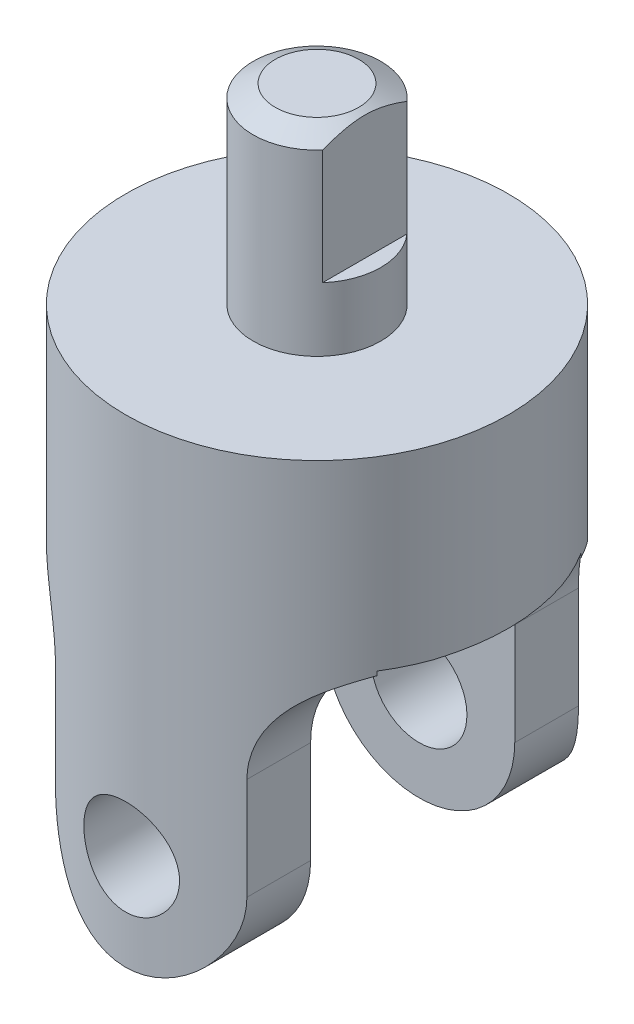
ISO-10303-21;
HEADER;
FILE_DESCRIPTION(('STEP AP214'),'2;1');
FILE_NAME('part.step','',(''),(''),'','','');
FILE_SCHEMA(('AUTOMOTIVE_DESIGN { 1 0 10303 214 1 1 1 1 }'));
ENDSEC;
DATA;
#1=APPLICATION_CONTEXT('core data for automotive mechanical design processes');
#2=APPLICATION_PROTOCOL_DEFINITION('international standard','automotive_design',2000,#1);
#3=PRODUCT_CONTEXT('',#1,'mechanical');
#4=PRODUCT('Part','Part','',(#3));
#5=PRODUCT_RELATED_PRODUCT_CATEGORY('part','',(#4));
#6=PRODUCT_DEFINITION_FORMATION('','',#4);
#7=PRODUCT_DEFINITION_CONTEXT('part definition',#1,'design');
#8=PRODUCT_DEFINITION('design','',#6,#7);
#9=PRODUCT_DEFINITION_SHAPE('','',#8);
#10=(LENGTH_UNIT() NAMED_UNIT(*) SI_UNIT(.MILLI.,.METRE.));
#11=(NAMED_UNIT(*) PLANE_ANGLE_UNIT() SI_UNIT($,.RADIAN.));
#12=(NAMED_UNIT(*) SI_UNIT($,.STERADIAN.) SOLID_ANGLE_UNIT());
#13=UNCERTAINTY_MEASURE_WITH_UNIT(LENGTH_MEASURE(1.E-05),#10,'distance_accuracy_value','');
#14=(GEOMETRIC_REPRESENTATION_CONTEXT(3) GLOBAL_UNCERTAINTY_ASSIGNED_CONTEXT((#13)) GLOBAL_UNIT_ASSIGNED_CONTEXT((#10,
#11,#12)) REPRESENTATION_CONTEXT('',''));
#15=CARTESIAN_POINT('',(0.,0.,0.));
#16=DIRECTION('',(0.,0.,1.));
#17=DIRECTION('',(1.,0.,0.));
#18=AXIS2_PLACEMENT_3D('',#15,#16,#17);
#19=CARTESIAN_POINT('',(0.,66.675,0.));
#20=DIRECTION('',(0.,-1.,0.));
#21=DIRECTION('',(0.,0.,-1.));
#22=AXIS2_PLACEMENT_3D('',#19,#20,#21);
#23=CYLINDRICAL_SURFACE('',#22,6.35);
#24=CARTESIAN_POINT('',(0.,47.625,0.));
#25=DIRECTION('',(0.,1.,0.));
#26=DIRECTION('',(0.,0.,1.));
#27=AXIS2_PLACEMENT_3D('',#24,#25,#26);
#28=CIRCLE('',#27,6.35);
#29=CARTESIAN_POINT('',(0.,47.625,6.35));
#30=VERTEX_POINT('',#29);
#31=EDGE_CURVE('E157',#30,#30,#28,.T.);
#32=ORIENTED_EDGE('',*,*,#31,.T.);
#33=EDGE_LOOP('',(#32));
#34=FACE_BOUND('',#33,.T.);
#35=DIRECTION('',(0.,1.,0.));
#36=VECTOR('',#35,1.);
#37=CARTESIAN_POINT('',(4.7625,53.975,4.20013020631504));
#38=LINE('',#37,#36);
#39=CARTESIAN_POINT('',(4.7625,53.975,4.20013020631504));
#40=VERTEX_POINT('',#39);
#41=CARTESIAN_POINT('',(4.7625,65.405,4.20013020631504));
#42=VERTEX_POINT('',#41);
#43=EDGE_CURVE('E146',#40,#42,#38,.T.);
#44=ORIENTED_EDGE('',*,*,#43,.T.);
#45=CARTESIAN_POINT('',(0.,65.405,0.));
#46=DIRECTION('',(0.,1.,0.));
#47=DIRECTION('',(0.,0.,1.));
#48=AXIS2_PLACEMENT_3D('',#45,#46,#47);
#49=CIRCLE('',#48,6.35);
#50=CARTESIAN_POINT('',(4.7625,65.405,-4.20013020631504));
#51=VERTEX_POINT('',#50);
#52=EDGE_CURVE('E40',#42,#51,#49,.F.);
#53=ORIENTED_EDGE('',*,*,#52,.T.);
#54=DIRECTION('',(0.,1.,0.));
#55=VECTOR('',#54,1.);
#56=CARTESIAN_POINT('',(4.7625,53.975,-4.20013020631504));
#57=LINE('',#56,#55);
#58=CARTESIAN_POINT('',(4.7625,53.975,-4.20013020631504));
#59=VERTEX_POINT('',#58);
#60=EDGE_CURVE('E47',#59,#51,#57,.T.);
#61=ORIENTED_EDGE('',*,*,#60,.F.);
#62=CARTESIAN_POINT('',(0.,53.975,0.));
#63=DIRECTION('',(0.,1.,0.));
#64=DIRECTION('',(0.,0.,1.));
#65=AXIS2_PLACEMENT_3D('',#62,#63,#64);
#66=CIRCLE('',#65,6.35);
#67=EDGE_CURVE('E149',#40,#59,#66,.T.);
#68=ORIENTED_EDGE('',*,*,#67,.F.);
#69=EDGE_LOOP('',(#44,#53,#61,#68));
#70=FACE_BOUND('',#69,.T.);
#71=ADVANCED_FACE('F26',(#34,#70),#23,.T.);
#72=CARTESIAN_POINT('',(0.,66.675,0.));
#73=DIRECTION('',(0.,-1.,0.));
#74=DIRECTION('',(0.,0.,-1.));
#75=AXIS2_PLACEMENT_3D('',#72,#73,#74);
#76=CONICAL_SURFACE('',#75,4.15029547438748,1.0471975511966);
#77=CARTESIAN_POINT('',(0.,66.675,0.));
#78=DIRECTION('',(0.,1.,0.));
#79=DIRECTION('',(0.,0.,1.));
#80=AXIS2_PLACEMENT_3D('',#77,#78,#79);
#81=CIRCLE('',#80,4.15029547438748);
#82=CARTESIAN_POINT('',(0.,66.675,4.15029547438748));
#83=VERTEX_POINT('',#82);
#84=EDGE_CURVE('E287',#83,#83,#81,.T.);
#85=ORIENTED_EDGE('',*,*,#84,.F.);
#86=EDGE_LOOP('',(#85));
#87=FACE_BOUND('',#86,.T.);
#88=ORIENTED_EDGE('',*,*,#52,.F.);
#89=CARTESIAN_POINT('',(4.7625,63.3576640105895,-8.67474438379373));
#90=CARTESIAN_POINT('',(4.7625,63.469711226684,-8.45330719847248));
#91=CARTESIAN_POINT('',(4.7625,63.5810014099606,-8.23148237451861));
#92=CARTESIAN_POINT('',(4.7625,63.8016576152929,-7.7868546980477));
#93=CARTESIAN_POINT('',(4.7625,63.9110234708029,-7.56405176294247));
#94=CARTESIAN_POINT('',(4.7625,64.1277386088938,-7.11660713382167));
#95=CARTESIAN_POINT('',(4.7625,64.2350805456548,-6.89196187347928));
#96=CARTESIAN_POINT('',(4.7625,64.4468042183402,-6.4412857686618));
#97=CARTESIAN_POINT('',(4.7625,64.551186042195,-6.21525496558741));
#98=CARTESIAN_POINT('',(4.7625,64.761300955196,-5.75026984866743));
#99=CARTESIAN_POINT('',(4.7625,64.8668450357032,-5.51122979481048));
#100=CARTESIAN_POINT('',(4.7625,65.0726380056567,-5.03084667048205));
#101=CARTESIAN_POINT('',(4.7625,65.1728864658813,-4.78950341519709));
#102=CARTESIAN_POINT('',(4.7625,65.3663272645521,-4.30430471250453));
#103=CARTESIAN_POINT('',(4.7625,65.4595275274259,-4.06045244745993));
#104=CARTESIAN_POINT('',(4.7625,65.6367537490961,-3.56945984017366));
#105=CARTESIAN_POINT('',(4.7625,65.7207816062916,-3.32232019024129));
#106=CARTESIAN_POINT('',(4.7625,65.8759823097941,-2.82653408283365));
#107=CARTESIAN_POINT('',(4.7625,65.9472687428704,-2.57792372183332));
#108=CARTESIAN_POINT('',(4.7625,66.0743145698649,-2.07671605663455));
#109=CARTESIAN_POINT('',(4.7625,66.1300751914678,-1.82411906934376));
#110=CARTESIAN_POINT('',(4.7625,66.2212225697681,-1.31963718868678));
#111=CARTESIAN_POINT('',(4.7625,66.2569437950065,-1.06781500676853));
#112=CARTESIAN_POINT('',(4.7625,66.2938959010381,-0.68850128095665));
#113=CARTESIAN_POINT('',(4.7625,66.3034417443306,-0.561789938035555));
#114=CARTESIAN_POINT('',(4.7625,66.3167609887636,-0.308068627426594));
#115=CARTESIAN_POINT('',(4.7625,66.3205349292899,-0.181058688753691));
#116=CARTESIAN_POINT('',(4.7625,66.3223134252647,0.0905838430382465));
#117=CARTESIAN_POINT('',(4.7625,66.3194472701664,0.235222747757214));
#118=CARTESIAN_POINT('',(4.7625,66.3061907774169,0.524155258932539));
#119=CARTESIAN_POINT('',(4.7625,66.2958001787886,0.66844885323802));
#120=CARTESIAN_POINT('',(4.7625,66.2678495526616,0.956362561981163));
#121=CARTESIAN_POINT('',(4.7625,66.2502880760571,1.09998253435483));
#122=CARTESIAN_POINT('',(4.7625,66.2085467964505,1.38625029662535));
#123=CARTESIAN_POINT('',(4.7625,66.18436689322,1.52889807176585));
#124=CARTESIAN_POINT('',(4.7625,66.1293852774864,1.81654493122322));
#125=CARTESIAN_POINT('',(4.7625,66.0984351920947,1.96151543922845));
#126=CARTESIAN_POINT('',(4.7625,66.0310411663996,2.25016667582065));
#127=CARTESIAN_POINT('',(4.7625,65.9945971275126,2.39384738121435));
#128=CARTESIAN_POINT('',(4.7625,65.9169451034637,2.67992954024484));
#129=CARTESIAN_POINT('',(4.7625,65.8757364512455,2.82233081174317));
#130=CARTESIAN_POINT('',(4.7625,65.7892365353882,3.10586895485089));
#131=CARTESIAN_POINT('',(4.7625,65.7439455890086,3.24700592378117));
#132=CARTESIAN_POINT('',(4.7625,65.6406667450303,3.55563142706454));
#133=CARTESIAN_POINT('',(4.7625,65.5819291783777,3.72286847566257));
#134=CARTESIAN_POINT('',(4.7625,65.4603269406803,4.05584009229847));
#135=CARTESIAN_POINT('',(4.7625,65.3974619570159,4.22157454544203));
#136=CARTESIAN_POINT('',(4.7625,65.2037410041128,4.71688299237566));
#137=CARTESIAN_POINT('',(4.7625,65.0677927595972,5.04446416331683));
#138=CARTESIAN_POINT('',(4.7625,64.7863691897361,5.69594921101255));
#139=CARTESIAN_POINT('',(4.7625,64.6408818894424,6.01984784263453));
#140=CARTESIAN_POINT('',(4.7625,64.3432582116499,6.66450132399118));
#141=CARTESIAN_POINT('',(4.7625,64.1911228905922,6.98525666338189));
#142=CARTESIAN_POINT('',(4.7625,63.8813253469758,7.62580230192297));
#143=CARTESIAN_POINT('',(4.7625,63.7236419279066,7.9455823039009));
#144=CARTESIAN_POINT('',(4.7625,63.4046196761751,8.58332268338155));
#145=CARTESIAN_POINT('',(4.7625,63.2432807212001,8.90128299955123));
#146=CARTESIAN_POINT('',(4.7625,62.9179416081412,9.53554216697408));
#147=CARTESIAN_POINT('',(4.7625,62.7539434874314,9.85184206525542));
#148=CARTESIAN_POINT('',(4.7625,62.4237848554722,10.4833121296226));
#149=CARTESIAN_POINT('',(4.7625,62.257624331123,10.7984822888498));
#150=CARTESIAN_POINT('',(4.7625,61.8068664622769,11.6479048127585));
#151=CARTESIAN_POINT('',(4.7625,61.5206664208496,12.181306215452));
#152=CARTESIAN_POINT('',(4.7625,60.9448108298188,13.2463803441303));
#153=CARTESIAN_POINT('',(4.7625,60.6551545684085,13.7780526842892));
#154=CARTESIAN_POINT('',(4.7625,60.0757028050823,14.8358326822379));
#155=CARTESIAN_POINT('',(4.7625,59.7859267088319,15.3619509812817));
#156=CARTESIAN_POINT('',(4.7625,59.2046035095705,16.4130517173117));
#157=CARTESIAN_POINT('',(4.7625,58.9130568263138,16.9380343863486));
#158=CARTESIAN_POINT('',(4.7625,58.620879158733,17.4626628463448));
#159=B_SPLINE_CURVE_WITH_KNOTS('',3,(#89,#90,#91,#92,#93,#94,#95,#96,#97,#98,#99,#100,#101,#102,
#103,#104,#105,#106,#107,#108,#109,#110,#111,#112,#113,#114,#115,#116,#117,#118,#119,#120,#121,
#122,#123,#124,#125,#126,#127,#128,#129,#130,#131,#132,#133,#134,#135,#136,#137,#138,#139,#140,
#141,#142,#143,#144,#145,#146,#147,#148,#149,#150,#151,#152,#153,#154,#155,#156,#157,#158),
.UNSPECIFIED.,.F.,.F.,(4,2,2,2,2,2,2,2,2,2,2,2,2,2,2,2,2,2,2,2,2,2,2,2,2,2,2,2,2,2,2,2,2,2,4),
(0.,0.744518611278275,1.48910134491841,2.23600427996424,2.98288500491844,3.7667475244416,
4.55067348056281,5.33370452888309,6.11657320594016,6.89207080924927,7.66750707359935,
8.42958338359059,8.81068147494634,9.19174395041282,9.6255420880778,10.0593552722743,
10.4932561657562,10.927163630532,11.3717539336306,11.8163522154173,12.2610128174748,
12.7056388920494,13.2373268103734,13.7690550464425,14.8328219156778,15.8979507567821,
16.9629109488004,18.0325121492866,19.102149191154,20.1710021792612,21.2398616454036,
23.0558392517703,24.8721975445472,26.6741189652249,28.4756286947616),.UNSPECIFIED.);
#160=EDGE_CURVE('E11',#42,#51,#159,.F.);
#161=ORIENTED_EDGE('',*,*,#160,.T.);
#162=EDGE_LOOP('',(#88,#161));
#163=FACE_BOUND('',#162,.T.);
#164=ADVANCED_FACE('F244',(#87,#163),#76,.T.);
#165=CARTESIAN_POINT('',(0.,47.625,0.));
#166=DIRECTION('',(0.,1.,0.));
#167=DIRECTION('',(0.,0.,1.));
#168=AXIS2_PLACEMENT_3D('',#165,#166,#167);
#169=PLANE('',#168);
#170=CARTESIAN_POINT('',(0.,47.625,0.));
#171=DIRECTION('',(0.,1.,0.));
#172=DIRECTION('',(0.,0.,1.));
#173=AXIS2_PLACEMENT_3D('',#170,#171,#172);
#174=CIRCLE('',#173,19.05);
#175=CARTESIAN_POINT('',(0.,47.625,19.05));
#176=VERTEX_POINT('',#175);
#177=EDGE_CURVE('E217',#176,#176,#174,.T.);
#178=ORIENTED_EDGE('',*,*,#177,.T.);
#179=EDGE_LOOP('',(#178));
#180=FACE_BOUND('',#179,.T.);
#181=ORIENTED_EDGE('',*,*,#31,.F.);
#182=EDGE_LOOP('',(#181));
#183=FACE_BOUND('',#182,.T.);
#184=ADVANCED_FACE('F242',(#180,#183),#169,.T.);
#185=CARTESIAN_POINT('',(0.,47.625,0.));
#186=DIRECTION('',(0.,-1.,0.));
#187=DIRECTION('',(0.,0.,-1.));
#188=AXIS2_PLACEMENT_3D('',#185,#186,#187);
#189=CYLINDRICAL_SURFACE('',#188,19.05);
#190=CARTESIAN_POINT('',(0.,14.2875,-19.05));
#191=CARTESIAN_POINT('',(-0.263131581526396,14.2874926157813,-19.0499955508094));
#192=CARTESIAN_POINT('',(-0.526345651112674,14.2656193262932,-19.0444938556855));
#193=CARTESIAN_POINT('',(-1.04523007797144,14.1788351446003,-19.0230796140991));
#194=CARTESIAN_POINT('',(-1.3008960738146,14.1138998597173,-19.0071611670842));
#195=CARTESIAN_POINT('',(-1.79711626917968,13.9432053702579,-18.966676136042));
#196=CARTESIAN_POINT('',(-2.03768821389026,13.837495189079,-18.9421199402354));
#197=CARTESIAN_POINT('',(-2.49768401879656,13.5884240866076,-18.886974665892));
#198=CARTESIAN_POINT('',(-2.71710716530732,13.4450618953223,-18.8563853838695));
#199=CARTESIAN_POINT('',(-3.1330961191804,13.121637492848,-18.7917903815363));
#200=CARTESIAN_POINT('',(-3.32916431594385,12.940945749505,-18.757731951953));
#201=CARTESIAN_POINT('',(-3.68855284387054,12.5493392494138,-18.6903874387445));
#202=CARTESIAN_POINT('',(-3.85186947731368,12.3384210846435,-18.6571014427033));
#203=CARTESIAN_POINT('',(-4.14345927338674,11.8884851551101,-18.5945391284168));
#204=CARTESIAN_POINT('',(-4.27117578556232,11.6490964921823,-18.5653297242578));
#205=CARTESIAN_POINT('',(-4.48436018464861,11.1513987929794,-18.514996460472));
#206=CARTESIAN_POINT('',(-4.56983482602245,10.8930927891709,-18.4938713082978));
#207=CARTESIAN_POINT('',(-4.69441160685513,10.3703643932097,-18.4626401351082));
#208=CARTESIAN_POINT('',(-4.73440845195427,10.1061682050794,-18.4523218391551));
#209=CARTESIAN_POINT('',(-4.76968113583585,9.57462979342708,-18.443237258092));
#210=CARTESIAN_POINT('',(-4.7649642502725,9.30728808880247,-18.4444690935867));
#211=CARTESIAN_POINT('',(-4.71165721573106,8.78390481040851,-18.4581547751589));
#212=CARTESIAN_POINT('',(-4.66413323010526,8.52774640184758,-18.4703359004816));
#213=CARTESIAN_POINT('',(-4.528261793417,8.02715866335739,-18.5041130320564));
#214=CARTESIAN_POINT('',(-4.43991143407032,7.78273017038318,-18.5257097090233));
#215=CARTESIAN_POINT('',(-4.22398659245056,7.30968179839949,-18.5761348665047));
#216=CARTESIAN_POINT('',(-4.09602516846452,7.08124640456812,-18.6050341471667));
#217=CARTESIAN_POINT('',(-3.80478117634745,6.6487080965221,-18.6667683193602));
#218=CARTESIAN_POINT('',(-3.64149242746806,6.44460944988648,-18.6996038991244));
#219=CARTESIAN_POINT('',(-3.27870637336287,6.06042852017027,-18.7666592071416));
#220=CARTESIAN_POINT('',(-3.07830936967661,5.88119699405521,-18.8008917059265));
#221=CARTESIAN_POINT('',(-2.64989283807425,5.55872255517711,-18.8660394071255));
#222=CARTESIAN_POINT('',(-2.42187246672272,5.41548074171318,-18.8969545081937));
#223=CARTESIAN_POINT('',(-1.94346794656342,5.16873938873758,-18.9521379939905));
#224=CARTESIAN_POINT('',(-1.69300967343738,5.06537804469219,-18.9763831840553));
#225=CARTESIAN_POINT('',(-1.17753132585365,4.90246255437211,-19.0153263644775));
#226=CARTESIAN_POINT('',(-0.912514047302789,4.84290002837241,-19.0300261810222));
#227=CARTESIAN_POINT('',(-0.382714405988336,4.77057222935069,-19.0479521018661));
#228=CARTESIAN_POINT('',(-0.118099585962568,4.75664839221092,-19.0514621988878));
#229=CARTESIAN_POINT('',(0.409679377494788,4.77281558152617,-19.0474220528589));
#230=CARTESIAN_POINT('',(0.672843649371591,4.80290264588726,-19.0398728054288));
#231=CARTESIAN_POINT('',(1.18622530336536,4.90528263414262,-19.0147442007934));
#232=CARTESIAN_POINT('',(1.43657675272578,4.97694351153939,-18.9973151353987));
#233=CARTESIAN_POINT('',(1.92169190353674,5.15971499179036,-18.9543914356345));
#234=CARTESIAN_POINT('',(2.15645402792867,5.27082957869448,-18.928895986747));
#235=CARTESIAN_POINT('',(2.60833595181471,5.5315997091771,-18.8719875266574));
#236=CARTESIAN_POINT('',(2.82506877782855,5.6819041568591,-18.8404775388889));
#237=CARTESIAN_POINT('',(3.23064699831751,6.015957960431,-18.7751881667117));
#238=CARTESIAN_POINT('',(3.41948756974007,6.19971308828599,-18.7414083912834));
#239=CARTESIAN_POINT('',(3.76869505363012,6.60083122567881,-18.6743643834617));
#240=CARTESIAN_POINT('',(3.92824927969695,6.81890845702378,-18.6411331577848));
#241=CARTESIAN_POINT('',(4.20849665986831,7.27942611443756,-18.5798738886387));
#242=CARTESIAN_POINT('',(4.32919153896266,7.5218654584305,-18.5518456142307));
#243=CARTESIAN_POINT('',(4.5273957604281,8.02292566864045,-18.5044745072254));
#244=CARTESIAN_POINT('',(4.60516095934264,8.28144021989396,-18.4850803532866));
#245=CARTESIAN_POINT('',(4.71597247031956,8.80843310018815,-18.457124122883));
#246=CARTESIAN_POINT('',(4.7490285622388,9.0769092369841,-18.4485596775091));
#247=CARTESIAN_POINT('',(4.76897252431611,9.6079342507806,-18.4434131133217));
#248=CARTESIAN_POINT('',(4.75715932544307,9.87043185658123,-18.4464938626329));
#249=CARTESIAN_POINT('',(4.69067285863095,10.3895648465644,-18.4635111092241));
#250=CARTESIAN_POINT('',(4.63600045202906,10.6462003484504,-18.4774473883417));
#251=CARTESIAN_POINT('',(4.48605693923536,11.1449118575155,-18.5144175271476));
#252=CARTESIAN_POINT('',(4.39102945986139,11.3870654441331,-18.5373967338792));
#253=CARTESIAN_POINT('',(4.1632661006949,11.8521650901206,-18.5898712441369));
#254=CARTESIAN_POINT('',(4.03052499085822,12.0751084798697,-18.6193674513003));
#255=CARTESIAN_POINT('',(3.72703010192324,12.5017359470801,-18.6825138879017));
#256=CARTESIAN_POINT('',(3.5553750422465,12.7047659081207,-18.7162524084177));
#257=CARTESIAN_POINT('',(3.18068125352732,13.0795618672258,-18.7835548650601));
#258=CARTESIAN_POINT('',(2.97763508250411,13.2513204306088,-18.8171187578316));
#259=CARTESIAN_POINT('',(2.54148458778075,13.5617309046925,-18.8810155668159));
#260=CARTESIAN_POINT('',(2.30790249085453,13.6997268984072,-18.911278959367));
#261=CARTESIAN_POINT('',(1.82011973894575,13.9342731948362,-18.9644313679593));
#262=CARTESIAN_POINT('',(1.56593401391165,14.0308531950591,-18.9873256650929));
#263=CARTESIAN_POINT('',(1.09350255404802,14.1654905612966,-19.0197758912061));
#264=CARTESIAN_POINT('',(0.87750704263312,14.2111451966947,-19.031032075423));
#265=CARTESIAN_POINT('',(0.441026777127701,14.2721518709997,-19.0461457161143));
#266=CARTESIAN_POINT('',(0.220542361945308,14.2875061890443,-19.0500037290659));
#267=CARTESIAN_POINT('',(0.,14.2875,-19.05));
#268=B_SPLINE_CURVE_WITH_KNOTS('',3,(#190,#191,#192,#193,#194,#195,#196,#197,#198,#199,#200,
#201,#202,#203,#204,#205,#206,#207,#208,#209,#210,#211,#212,#213,#214,#215,#216,#217,#218,#219,
#220,#221,#222,#223,#224,#225,#226,#227,#228,#229,#230,#231,#232,#233,#234,#235,#236,#237,#238,
#239,#240,#241,#242,#243,#244,#245,#246,#247,#248,#249,#250,#251,#252,#253,#254,#255,#256,#257,
#258,#259,#260,#261,#262,#263,#264,#265,#266,#267),.UNSPECIFIED.,.T.,.F.,(4,2,2,2,2,2,2,2,2,2,2,
2,2,2,2,2,2,2,2,2,2,2,2,2,2,2,2,2,2,2,2,2,2,2,2,2,2,2,4),(0.,0.78858653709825,1.57762015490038,
2.36570806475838,3.15382256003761,3.95650832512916,4.75928466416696,5.57398705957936,
6.38855914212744,7.18681236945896,7.98493571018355,8.76371428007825,9.54254833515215,
10.3292442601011,11.1160779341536,11.9253476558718,12.7346420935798,13.5467162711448,
14.3586350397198,15.1497763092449,15.940846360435,16.7201937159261,17.4996197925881,
18.2928764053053,19.08627002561,19.8991381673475,20.7119702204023,21.5199040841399,
22.3276611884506,23.1122150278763,23.8967531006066,24.6766207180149,25.4565965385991,
26.2569190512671,27.0574315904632,27.8724418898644,28.6868668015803,29.3478662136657,
30.008815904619),.UNSPECIFIED.);
#269=CARTESIAN_POINT('',(0.,14.2875,-19.05));
#270=VERTEX_POINT('',#269);
#271=EDGE_CURVE('E172',#270,#270,#268,.T.);
#272=ORIENTED_EDGE('',*,*,#271,.T.);
#273=EDGE_LOOP('',(#272));
#274=FACE_BOUND('',#273,.T.);
#275=CARTESIAN_POINT('',(4.7625,9.525,18.4450831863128));
#276=CARTESIAN_POINT('',(4.7624925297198,9.26201331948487,18.4450882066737));
#277=CARTESIAN_POINT('',(4.74064249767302,8.99894396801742,18.4507690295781));
#278=CARTESIAN_POINT('',(4.65395905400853,8.48035976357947,18.4728204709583));
#279=CARTESIAN_POINT('',(4.58910062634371,8.22484939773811,18.4891973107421));
#280=CARTESIAN_POINT('',(4.41863073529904,7.72895925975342,18.5306727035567));
#281=CARTESIAN_POINT('',(4.31307188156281,7.48856041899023,18.5557599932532));
#282=CARTESIAN_POINT('',(4.06435777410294,7.02885782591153,18.6118155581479));
#283=CARTESIAN_POINT('',(3.92120092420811,6.80955496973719,18.6427840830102));
#284=CARTESIAN_POINT('',(3.59798955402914,6.39344356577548,18.7078756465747));
#285=CARTESIAN_POINT('',(3.41725927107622,6.19716769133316,18.7420490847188));
#286=CARTESIAN_POINT('',(3.02548683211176,5.83737454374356,18.8092627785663));
#287=CARTESIAN_POINT('',(2.81444184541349,5.67386033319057,18.8423029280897));
#288=CARTESIAN_POINT('',(2.36438160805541,5.38205273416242,18.9040849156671));
#289=CARTESIAN_POINT('',(2.12501716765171,5.25428263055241,18.9327603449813));
#290=CARTESIAN_POINT('',(1.62737136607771,5.04099262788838,18.98200696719));
#291=CARTESIAN_POINT('',(1.36909280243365,4.95546649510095,19.0025793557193));
#292=CARTESIAN_POINT('',(0.846503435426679,4.8307983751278,19.0329456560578));
#293=CARTESIAN_POINT('',(0.582420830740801,4.79075182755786,19.0429494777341));
#294=CARTESIAN_POINT('',(0.0511089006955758,4.75534028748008,19.0517829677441));
#295=CARTESIAN_POINT('',(-0.216119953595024,4.75996868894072,19.0506142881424));
#296=CARTESIAN_POINT('',(-0.739865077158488,4.81312508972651,19.0373907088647));
#297=CARTESIAN_POINT('',(-0.996487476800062,4.86067669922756,19.0255779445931));
#298=CARTESIAN_POINT('',(-1.4979884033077,4.99676026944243,18.992675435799));
#299=CARTESIAN_POINT('',(-1.74286630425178,5.08529441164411,18.9715851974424));
#300=CARTESIAN_POINT('',(-2.21649942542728,5.30161989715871,18.9221270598));
#301=CARTESIAN_POINT('',(-2.44508897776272,5.42975872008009,18.8936951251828));
#302=CARTESIAN_POINT('',(-2.87786265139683,5.72139256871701,18.8326376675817));
#303=CARTESIAN_POINT('',(-3.08204251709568,5.88489374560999,18.8000114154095));
#304=CARTESIAN_POINT('',(-3.46602384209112,6.24784515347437,18.733078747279));
#305=CARTESIAN_POINT('',(-3.6450159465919,6.44814856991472,18.6987507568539));
#306=CARTESIAN_POINT('',(-3.96704999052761,6.87628794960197,18.6330915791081));
#307=CARTESIAN_POINT('',(-4.11009024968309,7.10412519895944,18.6017605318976));
#308=CARTESIAN_POINT('',(-4.35667846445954,7.58245251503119,18.5455654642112));
#309=CARTESIAN_POINT('',(-4.46003156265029,7.8330470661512,18.5207335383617));
#310=CARTESIAN_POINT('',(-4.6228902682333,8.34882531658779,18.4807600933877));
#311=CARTESIAN_POINT('',(-4.68240525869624,8.61400588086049,18.4656165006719));
#312=CARTESIAN_POINT('',(-4.75455546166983,9.14392285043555,18.4471695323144));
#313=CARTESIAN_POINT('',(-4.76838735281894,9.40848599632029,18.4435639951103));
#314=CARTESIAN_POINT('',(-4.75205486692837,9.93614078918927,18.4477788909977));
#315=CARTESIAN_POINT('',(-4.72189453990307,10.1992325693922,18.4555982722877));
#316=CARTESIAN_POINT('',(-4.61948300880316,10.7120326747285,18.4814924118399));
#317=CARTESIAN_POINT('',(-4.54792855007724,10.9618895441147,18.4993972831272));
#318=CARTESIAN_POINT('',(-4.36553244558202,11.4460619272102,18.5432836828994));
#319=CARTESIAN_POINT('',(-4.25468614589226,11.6803755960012,18.5692661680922));
#320=CARTESIAN_POINT('',(-3.99434812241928,12.1318806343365,18.6270164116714));
#321=CARTESIAN_POINT('',(-3.84414094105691,12.3486459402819,18.6588876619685));
#322=CARTESIAN_POINT('',(-3.51024964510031,12.7543338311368,18.7245704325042));
#323=CARTESIAN_POINT('',(-3.32656002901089,12.9432518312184,18.7583822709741));
#324=CARTESIAN_POINT('',(-2.92542620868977,13.2927300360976,18.8251605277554));
#325=CARTESIAN_POINT('',(-2.70725242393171,13.4524624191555,18.8580846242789));
#326=CARTESIAN_POINT('',(-2.24648402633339,13.7330228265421,18.9185019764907));
#327=CARTESIAN_POINT('',(-2.00389068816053,13.8538528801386,18.9459955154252));
#328=CARTESIAN_POINT('',(-1.50284593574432,14.0521296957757,18.9922807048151));
#329=CARTESIAN_POINT('',(-1.24452402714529,14.1298884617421,19.0111347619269));
#330=CARTESIAN_POINT('',(-0.717945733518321,14.240751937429,19.0382898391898));
#331=CARTESIAN_POINT('',(-0.449691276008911,14.2738652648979,19.0465928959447));
#332=CARTESIAN_POINT('',(0.0813602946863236,14.2940131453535,19.0516273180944));
#333=CARTESIAN_POINT('',(0.344108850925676,14.2822693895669,19.0486654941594));
#334=CARTESIAN_POINT('',(0.863762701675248,14.2158347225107,19.0321833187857));
#335=CARTESIAN_POINT('',(1.12066816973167,14.1611450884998,19.0186632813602));
#336=CARTESIAN_POINT('',(1.62006455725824,14.0110263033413,18.9826312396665));
#337=CARTESIAN_POINT('',(1.86262563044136,13.9158180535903,18.9601680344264));
#338=CARTESIAN_POINT('',(2.32846746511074,13.6875651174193,18.908615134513));
#339=CARTESIAN_POINT('',(2.55174579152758,13.5545156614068,18.8795246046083));
#340=CARTESIAN_POINT('',(2.97847668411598,13.2506311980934,18.8169827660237));
#341=CARTESIAN_POINT('',(3.18132613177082,13.0789673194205,18.7834436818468));
#342=CARTESIAN_POINT('',(3.55575403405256,12.7043361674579,18.7161796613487));
#343=CARTESIAN_POINT('',(3.72732454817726,12.5013609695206,18.6824546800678));
#344=CARTESIAN_POINT('',(4.0374666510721,12.0653107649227,18.6179210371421));
#345=CARTESIAN_POINT('',(4.1753628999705,11.831744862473,18.5871785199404));
#346=CARTESIAN_POINT('',(4.4097268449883,11.3440107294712,18.5329808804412));
#347=CARTESIAN_POINT('',(4.50622468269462,11.0898576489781,18.5095204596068));
#348=CARTESIAN_POINT('',(4.6406872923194,10.6176269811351,18.4762096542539));
#349=CARTESIAN_POINT('',(4.68626747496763,10.401808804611,18.4646250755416));
#350=CARTESIAN_POINT('',(4.74717566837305,9.96567951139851,18.4490600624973));
#351=CARTESIAN_POINT('',(4.76250625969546,9.74536877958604,18.4450789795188));
#352=CARTESIAN_POINT('',(4.7625,9.525,18.4450831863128));
#353=B_SPLINE_CURVE_WITH_KNOTS('',3,(#275,#276,#277,#278,#279,#280,#281,#282,#283,#284,#285,
#286,#287,#288,#289,#290,#291,#292,#293,#294,#295,#296,#297,#298,#299,#300,#301,#302,#303,#304,
#305,#306,#307,#308,#309,#310,#311,#312,#313,#314,#315,#316,#317,#318,#319,#320,#321,#322,#323,
#324,#325,#326,#327,#328,#329,#330,#331,#332,#333,#334,#335,#336,#337,#338,#339,#340,#341,#342,
#343,#344,#345,#346,#347,#348,#349,#350,#351,#352),.UNSPECIFIED.,.T.,.F.,(4,2,2,2,2,2,2,2,2,2,2,
2,2,2,2,2,2,2,2,2,2,2,2,2,2,2,2,2,2,2,2,2,2,2,2,2,2,2,4),(0.,0.788150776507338,1.57676038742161,
2.36435403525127,3.15198112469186,3.95523632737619,4.75856658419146,5.57310600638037,
6.3875251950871,7.18544570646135,7.98324823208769,8.76334790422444,9.54348910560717,
10.3306792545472,11.1180064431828,11.9266423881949,12.7353161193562,13.5479110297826,
14.3603319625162,15.1512950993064,15.9421854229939,16.7201355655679,17.4981778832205,
18.2914832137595,19.0849190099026,19.8982075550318,20.7114536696,21.5187289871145,
22.3258484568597,23.1111446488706,23.896417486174,24.677462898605,25.4586067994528,
26.258464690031,27.0585253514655,27.8735118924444,28.6879040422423,29.3483886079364,
30.0088168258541),.UNSPECIFIED.);
#354=CARTESIAN_POINT('',(4.7625,9.525,18.4450831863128));
#355=VERTEX_POINT('',#354);
#356=EDGE_CURVE('E166',#355,#355,#353,.T.);
#357=ORIENTED_EDGE('',*,*,#356,.T.);
#358=EDGE_LOOP('',(#357));
#359=FACE_BOUND('',#358,.T.);
#360=ORIENTED_EDGE('',*,*,#177,.F.);
#361=EDGE_LOOP('',(#360));
#362=FACE_BOUND('',#361,.T.);
#363=DIRECTION('',(0.,-1.,0.));
#364=VECTOR('',#363,1.);
#365=CARTESIAN_POINT('',(16.1144934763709,47.625,10.16));
#366=LINE('',#365,#364);
#367=CARTESIAN_POINT('',(16.1144934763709,29.1452388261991,10.16));
#368=VERTEX_POINT('',#367);
#369=CARTESIAN_POINT('',(16.1144934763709,28.7463700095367,10.16));
#370=VERTEX_POINT('',#369);
#371=EDGE_CURVE('E359',#368,#370,#366,.T.);
#372=ORIENTED_EDGE('',*,*,#371,.F.);
#373=CARTESIAN_POINT('',(0.,29.1452388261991,0.));
#374=DIRECTION('',(0.,1.,0.));
#375=DIRECTION('',(0.,0.,1.));
#376=AXIS2_PLACEMENT_3D('',#373,#374,#375);
#377=CIRCLE('',#376,19.05);
#378=CARTESIAN_POINT('',(17.9411689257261,29.1452388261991,6.40444826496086));
#379=VERTEX_POINT('',#378);
#380=EDGE_CURVE('E356',#368,#379,#377,.T.);
#381=ORIENTED_EDGE('',*,*,#380,.T.);
#382=CARTESIAN_POINT('',(19.05,29.21,0.));
#383=CARTESIAN_POINT('',(19.049996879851,29.2100103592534,0.533382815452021));
#384=CARTESIAN_POINT('',(19.027578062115,29.2100818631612,1.06690565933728));
#385=CARTESIAN_POINT('',(18.9380246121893,29.2094440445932,2.13043914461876));
#386=CARTESIAN_POINT('',(18.8708627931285,29.2087342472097,2.66044745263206));
#387=CARTESIAN_POINT('',(18.6920678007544,29.2036935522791,3.71420914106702));
#388=CARTESIAN_POINT('',(18.580329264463,29.1993540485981,4.23794465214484));
#389=CARTESIAN_POINT('',(18.3132283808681,29.1824053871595,5.2739113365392));
#390=CARTESIAN_POINT('',(18.1578801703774,29.1697989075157,5.78614617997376));
#391=CARTESIAN_POINT('',(17.8379784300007,29.1336698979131,6.70057379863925));
#392=CARTESIAN_POINT('',(17.6806127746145,29.11263742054,7.1053906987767));
#393=CARTESIAN_POINT('',(17.3389574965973,29.0566565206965,7.90259710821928));
#394=CARTESIAN_POINT('',(17.1546670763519,29.0217076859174,8.29498624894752));
#395=CARTESIAN_POINT('',(16.761130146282,28.9330965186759,9.06383570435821));
#396=CARTESIAN_POINT('',(16.5519382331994,28.8794746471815,9.44032850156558));
#397=CARTESIAN_POINT('',(16.1105999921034,28.7480309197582,10.1751907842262));
#398=CARTESIAN_POINT('',(15.8784623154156,28.6702181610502,10.5335670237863));
#399=CARTESIAN_POINT('',(15.463528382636,28.5109376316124,11.1298585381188));
#400=CARTESIAN_POINT('',(15.2854727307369,28.4368014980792,11.3730490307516));
#401=CARTESIAN_POINT('',(14.9211708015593,28.2709441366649,11.8469571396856));
#402=CARTESIAN_POINT('',(14.7349266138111,28.1792273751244,12.0776779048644));
#403=CARTESIAN_POINT('',(14.3566350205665,27.9761989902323,12.5249854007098));
#404=CARTESIAN_POINT('',(14.1645929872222,27.8649050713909,12.7415846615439));
#405=CARTESIAN_POINT('',(13.7773567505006,27.6208175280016,13.1593312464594));
#406=CARTESIAN_POINT('',(13.5821630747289,27.4880274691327,13.3604811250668));
#407=CARTESIAN_POINT('',(13.2244608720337,27.2235429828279,13.7138049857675));
#408=CARTESIAN_POINT('',(13.061916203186,27.0953403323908,13.8685600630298));
#409=CARTESIAN_POINT('',(12.7392126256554,26.8225209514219,14.1655575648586));
#410=CARTESIAN_POINT('',(12.5790532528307,26.6779074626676,14.3078024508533));
#411=CARTESIAN_POINT('',(12.2635124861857,26.3721121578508,14.5791656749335));
#412=CARTESIAN_POINT('',(12.1081305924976,26.210932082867,14.7082853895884));
#413=CARTESIAN_POINT('',(11.8046267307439,25.8722360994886,14.952969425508));
#414=CARTESIAN_POINT('',(11.6565048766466,25.6947199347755,15.0685335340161));
#415=CARTESIAN_POINT('',(11.3693565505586,25.3231488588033,15.286362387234));
#416=CARTESIAN_POINT('',(11.2303760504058,25.129020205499,15.388562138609));
#417=CARTESIAN_POINT('',(10.9647092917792,24.726025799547,15.578972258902));
#418=CARTESIAN_POINT('',(10.8380232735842,24.517159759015,15.6671823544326));
#419=CARTESIAN_POINT('',(10.5991808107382,24.0861350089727,15.8297425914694));
#420=CARTESIAN_POINT('',(10.4870246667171,23.8639760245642,15.9040924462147));
#421=CARTESIAN_POINT('',(10.2792087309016,23.4081145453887,16.0391940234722));
#422=CARTESIAN_POINT('',(10.1835477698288,23.1744128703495,16.099946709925));
#423=CARTESIAN_POINT('',(10.0176697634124,22.7175915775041,16.2036271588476));
#424=CARTESIAN_POINT('',(9.9459860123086,22.4952456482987,16.2476271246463));
#425=CARTESIAN_POINT('',(9.81880485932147,22.0441456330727,16.3248005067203));
#426=CARTESIAN_POINT('',(9.76330648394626,21.8153919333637,16.3579745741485));
#427=CARTESIAN_POINT('',(9.66925566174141,21.3531951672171,16.413743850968));
#428=CARTESIAN_POINT('',(9.63070088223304,21.1197527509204,16.4363405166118));
#429=CARTESIAN_POINT('',(9.57103843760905,20.6498812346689,16.4711541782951));
#430=CARTESIAN_POINT('',(9.54993079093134,20.4134521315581,16.4833711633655));
#431=CARTESIAN_POINT('',(9.52570969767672,19.9446128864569,16.4973798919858));
#432=CARTESIAN_POINT('',(9.52220909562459,19.7122293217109,16.4993959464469));
#433=CARTESIAN_POINT('',(9.53219956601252,19.2479529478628,16.4936262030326));
#434=CARTESIAN_POINT('',(9.54569028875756,19.0160601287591,16.4858406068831));
#435=CARTESIAN_POINT('',(9.58949302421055,18.554432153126,16.4603998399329));
#436=CARTESIAN_POINT('',(9.6198038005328,18.3246968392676,16.4427453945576));
#437=CARTESIAN_POINT('',(9.69686292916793,17.8690016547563,16.3974188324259));
#438=CARTESIAN_POINT('',(9.74361132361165,17.6430417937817,16.3697466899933));
#439=CARTESIAN_POINT('',(9.85288207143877,17.196754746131,16.3042100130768));
#440=CARTESIAN_POINT('',(9.91538653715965,16.9764214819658,16.2663570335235));
#441=CARTESIAN_POINT('',(10.0553731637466,16.5426686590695,16.180195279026));
#442=CARTESIAN_POINT('',(10.1328552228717,16.3292490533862,16.1318865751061));
#443=CARTESIAN_POINT('',(10.3017409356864,15.910813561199,16.0245634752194));
#444=CARTESIAN_POINT('',(10.3931426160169,15.7057964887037,15.9655505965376));
#445=CARTESIAN_POINT('',(10.5886157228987,15.3054773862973,15.8365848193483));
#446=CARTESIAN_POINT('',(10.6926871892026,15.1101753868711,15.7666318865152));
#447=CARTESIAN_POINT('',(10.9127809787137,14.7291938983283,15.6151103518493));
#448=CARTESIAN_POINT('',(11.0288790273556,14.5435880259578,15.5334667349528));
#449=CARTESIAN_POINT('',(11.2707794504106,14.184433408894,15.3588499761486));
#450=CARTESIAN_POINT('',(11.3965817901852,14.0108846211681,15.2658768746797));
#451=CARTESIAN_POINT('',(11.6561087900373,13.6766079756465,15.0686489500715));
#452=CARTESIAN_POINT('',(11.7898334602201,13.5158801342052,14.9643941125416));
#453=CARTESIAN_POINT('',(12.0633573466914,13.2077398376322,14.7447844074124));
#454=CARTESIAN_POINT('',(12.2031567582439,13.0603278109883,14.6294291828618));
#455=CARTESIAN_POINT('',(12.4937638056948,12.772314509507,14.3821580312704));
#456=CARTESIAN_POINT('',(12.644778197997,12.6323757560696,14.2497140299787));
#457=CARTESIAN_POINT('',(12.9493736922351,12.3672984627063,13.9734925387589));
#458=CARTESIAN_POINT('',(13.1029548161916,12.242160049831,13.8297149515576));
#459=CARTESIAN_POINT('',(13.4107980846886,12.0062865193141,13.5314054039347));
#460=CARTESIAN_POINT('',(13.5650603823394,11.8955548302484,13.3768708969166));
#461=CARTESIAN_POINT('',(13.8725108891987,11.6878966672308,13.0577594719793));
#462=CARTESIAN_POINT('',(14.0256988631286,11.5909731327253,12.8931804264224));
#463=CARTESIAN_POINT('',(14.39837780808,11.3691080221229,12.4779134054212));
#464=CARTESIAN_POINT('',(14.6164221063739,11.2514021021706,12.2220315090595));
#465=CARTESIAN_POINT('',(15.0430905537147,11.0405220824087,11.6928866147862));
#466=CARTESIAN_POINT('',(15.251711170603,10.947357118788,11.4196171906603));
#467=CARTESIAN_POINT('',(15.6569663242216,10.7821388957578,10.8573587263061));
#468=CARTESIAN_POINT('',(15.8535749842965,10.7101300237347,10.5683381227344));
#469=CARTESIAN_POINT('',(16.2321389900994,10.5841718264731,9.97714699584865));
#470=CARTESIAN_POINT('',(16.4140939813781,10.5302229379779,9.67497615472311));
#471=CARTESIAN_POINT('',(16.8245793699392,10.4203775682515,8.9480418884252));
#472=CARTESIAN_POINT('',(17.0462056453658,10.3708109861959,8.51840770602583));
#473=CARTESIAN_POINT('',(17.4567300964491,10.2918741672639,7.64195817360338));
#474=CARTESIAN_POINT('',(17.645616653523,10.2625110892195,7.19513679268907));
#475=CARTESIAN_POINT('',(17.9889969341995,10.2176935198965,6.28760456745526));
#476=CARTESIAN_POINT('',(18.1434753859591,10.20224519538,5.82688765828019));
#477=CARTESIAN_POINT('',(18.4167998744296,10.1800812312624,4.89487865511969));
#478=CARTESIAN_POINT('',(18.5356492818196,10.1733647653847,4.42358756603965));
#479=CARTESIAN_POINT('',(18.7390770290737,10.164519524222,3.4634194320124));
#480=CARTESIAN_POINT('',(18.8228945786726,10.1624886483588,2.97438032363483));
#481=CARTESIAN_POINT('',(18.9521307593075,10.1602834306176,1.99124760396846));
#482=CARTESIAN_POINT('',(18.9975487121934,10.1601091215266,1.49715390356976));
#483=CARTESIAN_POINT('',(19.0497076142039,10.1599638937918,0.506913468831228));
#484=CARTESIAN_POINT('',(19.056447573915,10.159992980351,0.0107666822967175));
#485=CARTESIAN_POINT('',(19.0312083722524,10.1600110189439,-0.9805421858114));
#486=CARTESIAN_POINT('',(18.9992283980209,10.159999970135,-1.47570424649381));
#487=CARTESIAN_POINT('',(18.8926312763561,10.1611364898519,-2.50154876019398));
#488=CARTESIAN_POINT('',(18.8148050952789,10.1623769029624,-3.0319006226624));
#489=CARTESIAN_POINT('',(18.6147375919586,10.1694249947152,-4.08423134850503));
#490=CARTESIAN_POINT('',(18.4924884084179,10.1752334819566,-4.60620871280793));
#491=CARTESIAN_POINT('',(18.2045264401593,10.1964999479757,-5.63777006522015));
#492=CARTESIAN_POINT('',(18.038820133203,10.2119564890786,-6.14735588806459));
#493=CARTESIAN_POINT('',(17.665376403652,10.2592968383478,-7.15002542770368));
#494=CARTESIAN_POINT('',(17.4576550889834,10.2911743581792,-7.64311538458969));
#495=CARTESIAN_POINT('',(17.0684462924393,10.3669485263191,-8.46843599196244));
#496=CARTESIAN_POINT('',(16.8967847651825,10.4046902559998,-8.80589420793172));
#497=CARTESIAN_POINT('',(16.5346560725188,10.4962259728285,-9.46837085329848));
#498=CARTESIAN_POINT('',(16.3441901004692,10.550018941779,-9.79339007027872));
#499=CARTESIAN_POINT('',(15.9465991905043,10.6773359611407,-10.428254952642));
#500=CARTESIAN_POINT('',(15.739505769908,10.7508232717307,-10.7381276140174));
#501=CARTESIAN_POINT('',(15.3108822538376,10.9215647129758,-11.3408987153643));
#502=CARTESIAN_POINT('',(15.0893560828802,11.0188124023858,-11.6338017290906));
#503=CARTESIAN_POINT('',(14.6895799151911,11.2145005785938,-12.1324012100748));
#504=CARTESIAN_POINT('',(14.5136187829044,11.3071178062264,-12.342227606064));
#505=CARTESIAN_POINT('',(14.1573921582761,11.5100375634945,-12.7492675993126));
#506=CARTESIAN_POINT('',(13.9771277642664,11.6203356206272,-12.946484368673));
#507=CARTESIAN_POINT('',(13.614703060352,11.8600174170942,-13.3270930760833));
#508=CARTESIAN_POINT('',(13.4325430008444,11.9893986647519,-13.5104868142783));
#509=CARTESIAN_POINT('',(13.0691389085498,12.2683044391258,-13.8623255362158));
#510=CARTESIAN_POINT('',(12.8878948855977,12.4178291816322,-14.0307703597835));
#511=CARTESIAN_POINT('',(12.5278873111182,12.7390387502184,-14.3531691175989));
#512=CARTESIAN_POINT('',(12.3491614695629,12.9109132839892,-14.5069768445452));
#513=CARTESIAN_POINT('',(11.9994369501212,13.2757087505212,-14.7975578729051));
#514=CARTESIAN_POINT('',(11.82843847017,13.4686302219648,-14.9343307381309));
#515=CARTESIAN_POINT('',(11.4978748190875,13.8747043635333,-15.1902955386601));
#516=CARTESIAN_POINT('',(11.3383044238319,14.0878476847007,-15.309495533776));
#517=CARTESIAN_POINT('',(11.0340362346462,14.5330485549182,-15.5302251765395));
#518=CARTESIAN_POINT('',(10.8893360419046,14.7651030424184,-15.6317576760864));
#519=CARTESIAN_POINT('',(10.6375938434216,15.2114194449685,-15.8039202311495));
#520=CARTESIAN_POINT('',(10.5281305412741,15.4234197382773,-15.8768952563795));
#521=CARTESIAN_POINT('',(10.3241959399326,15.8583011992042,-16.0102570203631));
#522=CARTESIAN_POINT('',(10.2297230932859,16.0811812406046,-16.0706450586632));
#523=CARTESIAN_POINT('',(10.0572751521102,16.5360809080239,-16.179125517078));
#524=CARTESIAN_POINT('',(9.97929736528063,16.7680990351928,-16.2272199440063));
#525=CARTESIAN_POINT('',(9.84102162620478,17.239461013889,-16.311448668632));
#526=CARTESIAN_POINT('',(9.78072332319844,17.4788047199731,-16.3475832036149));
#527=CARTESIAN_POINT('',(9.68188771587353,17.9477871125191,-16.4062987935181));
#528=CARTESIAN_POINT('',(9.64222956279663,18.1771026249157,-16.4295834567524));
#529=CARTESIAN_POINT('',(9.5797648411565,18.6388017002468,-16.46608390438));
#530=CARTESIAN_POINT('',(9.55695739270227,18.8711851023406,-16.4793002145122));
#531=CARTESIAN_POINT('',(9.52848426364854,19.3373197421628,-16.4957800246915));
#532=CARTESIAN_POINT('',(9.52281640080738,19.5710708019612,-16.4990447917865));
#533=CARTESIAN_POINT('',(9.52868739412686,20.0382873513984,-16.4956548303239));
#534=CARTESIAN_POINT('',(9.54022638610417,20.2717528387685,-16.4890000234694));
#535=CARTESIAN_POINT('',(9.58021982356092,20.7350247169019,-16.4657953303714));
#536=CARTESIAN_POINT('',(9.60855109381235,20.9648453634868,-16.4493174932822));
#537=CARTESIAN_POINT('',(9.68167117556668,21.4209069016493,-16.4063871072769));
#538=CARTESIAN_POINT('',(9.72645981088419,21.6471478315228,-16.3799346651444));
#539=CARTESIAN_POINT('',(9.83191636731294,22.0944292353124,-16.316852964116));
#540=CARTESIAN_POINT('',(9.89258292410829,22.3154701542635,-16.2802245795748));
#541=CARTESIAN_POINT('',(10.0290018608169,22.7508198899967,-16.1965434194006));
#542=CARTESIAN_POINT('',(10.1047542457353,22.9651287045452,-16.1494906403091));
#543=CARTESIAN_POINT('',(10.2704188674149,23.3857746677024,-16.0446442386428));
#544=CARTESIAN_POINT('',(10.3603467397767,23.5921026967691,-15.9868387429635));
#545=CARTESIAN_POINT('',(10.5530613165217,23.9951691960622,-15.8602861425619));
#546=CARTESIAN_POINT('',(10.6558479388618,24.1919077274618,-15.7915391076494));
#547=CARTESIAN_POINT('',(10.8728256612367,24.5745618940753,-15.6429358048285));
#548=CARTESIAN_POINT('',(10.987015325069,24.7604788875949,-15.5630809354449));
#549=CARTESIAN_POINT('',(11.225197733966,25.1205023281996,-15.392170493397));
#550=CARTESIAN_POINT('',(11.3491905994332,25.2946086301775,-15.3011147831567));
#551=CARTESIAN_POINT('',(11.6077455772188,25.6335112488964,-15.1059418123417));
#552=CARTESIAN_POINT('',(11.7424670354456,25.7980587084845,-15.0016038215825));
#553=CARTESIAN_POINT('',(12.0183672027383,26.1135051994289,-14.7814913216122));
#554=CARTESIAN_POINT('',(12.1595459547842,26.26440413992,-14.6657167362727));
#555=CARTESIAN_POINT('',(12.4464439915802,26.5523126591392,-14.4230312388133));
#556=CARTESIAN_POINT('',(12.5921638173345,26.689320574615,-14.2961189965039));
#557=CARTESIAN_POINT('',(12.8862640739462,26.94947115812,-14.0316008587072));
#558=CARTESIAN_POINT('',(13.0346448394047,27.072612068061,-13.8939936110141));
#559=CARTESIAN_POINT('',(13.3452197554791,27.3154169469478,-13.5962421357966));
#560=CARTESIAN_POINT('',(13.5074942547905,27.433849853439,-13.4351785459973));
#561=CARTESIAN_POINT('',(13.8310228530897,27.6553417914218,-13.1018801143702));
#562=CARTESIAN_POINT('',(13.9922769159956,27.7584002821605,-12.9296448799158));
#563=CARTESIAN_POINT('',(14.3120094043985,27.9500970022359,-12.5748130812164));
#564=CARTESIAN_POINT('',(14.470487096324,28.038731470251,-12.3922138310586));
#565=CARTESIAN_POINT('',(14.783117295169,28.20265806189,-12.0175512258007));
#566=CARTESIAN_POINT('',(14.937268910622,28.2779474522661,-11.8254859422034));
#567=CARTESIAN_POINT('',(15.326265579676,28.4558463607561,-11.3207512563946));
#568=CARTESIAN_POINT('',(15.557013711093,28.5495617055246,-11.001748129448));
#569=CARTESIAN_POINT('',(16.0008943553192,28.7118757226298,-10.3455804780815));
#570=CARTESIAN_POINT('',(16.2140186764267,28.7804627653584,-10.0084076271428));
#571=CARTESIAN_POINT('',(16.6205587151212,28.8973996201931,-9.31775414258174));
#572=CARTESIAN_POINT('',(16.8139169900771,28.9456916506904,-8.96423008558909));
#573=CARTESIAN_POINT('',(17.1784152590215,29.0261782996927,-8.24423725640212));
#574=CARTESIAN_POINT('',(17.3495560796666,29.0583735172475,-7.87776896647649));
#575=CARTESIAN_POINT('',(17.7139507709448,29.1181250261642,-7.02772612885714));
#576=CARTESIAN_POINT('',(17.8995689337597,29.1417328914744,-6.54058775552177));
#577=CARTESIAN_POINT('',(18.2303913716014,29.1761282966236,-5.55221872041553));
#578=CARTESIAN_POINT('',(18.3755800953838,29.1869109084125,-5.05098271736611));
#579=CARTESIAN_POINT('',(18.6240927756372,29.2012851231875,-4.03935328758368));
#580=CARTESIAN_POINT('',(18.7275094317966,29.2048927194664,-3.52898279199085));
#581=CARTESIAN_POINT('',(18.8921736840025,29.2090510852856,-2.50172549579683));
#582=CARTESIAN_POINT('',(18.9534464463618,29.209603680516,-1.98484277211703));
#583=CARTESIAN_POINT('',(19.0123093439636,29.2099398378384,-1.22250024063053));
#584=CARTESIAN_POINT('',(19.0264404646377,29.2099756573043,-0.97821891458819));
#585=CARTESIAN_POINT('',(19.045286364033,29.2100033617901,-0.489301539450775));
#586=CARTESIAN_POINT('',(19.0500014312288,29.209995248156,-0.244665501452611));
#587=CARTESIAN_POINT('',(19.05,29.21,0.));
#588=B_SPLINE_CURVE_WITH_KNOTS('',3,(#382,#383,#384,#385,#386,#387,#388,#389,#390,#391,#392,
#393,#394,#395,#396,#397,#398,#399,#400,#401,#402,#403,#404,#405,#406,#407,#408,#409,#410,#411,
#412,#413,#414,#415,#416,#417,#418,#419,#420,#421,#422,#423,#424,#425,#426,#427,#428,#429,#430,
#431,#432,#433,#434,#435,#436,#437,#438,#439,#440,#441,#442,#443,#444,#445,#446,#447,#448,#449,
#450,#451,#452,#453,#454,#455,#456,#457,#458,#459,#460,#461,#462,#463,#464,#465,#466,#467,#468,
#469,#470,#471,#472,#473,#474,#475,#476,#477,#478,#479,#480,#481,#482,#483,#484,#485,#486,#487,
#488,#489,#490,#491,#492,#493,#494,#495,#496,#497,#498,#499,#500,#501,#502,#503,#504,#505,#506,
#507,#508,#509,#510,#511,#512,#513,#514,#515,#516,#517,#518,#519,#520,#521,#522,#523,#524,#525,
#526,#527,#528,#529,#530,#531,#532,#533,#534,#535,#536,#537,#538,#539,#540,#541,#542,#543,#544,
#545,#546,#547,#548,#549,#550,#551,#552,#553,#554,#555,#556,#557,#558,#559,#560,#561,#562,#563,
#564,#565,#566,#567,#568,#569,#570,#571,#572,#573,#574,#575,#576,#577,#578,#579,#580,#581,#582,
#583,#584,#585,#586,#587),.UNSPECIFIED.,.T.,.F.,(4,2,2,2,2,2,2,2,2,2,2,2,2,2,2,2,2,2,2,2,2,2,2,
2,2,2,2,2,2,2,2,2,2,2,2,2,2,2,2,2,2,2,2,2,2,2,2,2,2,2,2,2,2,2,2,2,2,2,2,2,2,2,2,2,2,2,2,2,2,2,2,
2,2,2,2,2,2,2,2,2,2,2,2,2,2,2,2,2,2,2,2,2,2,2,2,2,2,2,2,2,2,2,4),(0.,1.59992202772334,
3.2008170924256,4.80551871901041,6.4097007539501,7.71308875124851,9.0165153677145,
10.3171350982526,11.6172663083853,12.5476837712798,13.4778651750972,14.4072096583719,
15.3364001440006,16.1110321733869,16.8855114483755,17.6599094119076,18.4343195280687,
19.2123657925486,19.9904272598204,20.768504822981,21.5465272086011,22.2588286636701,
22.9710872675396,23.683247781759,24.3954090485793,25.0918401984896,25.7882570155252,
26.4846226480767,27.1809900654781,27.8765704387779,28.5721460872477,29.2676232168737,
29.9631025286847,30.6632630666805,31.3634211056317,32.0635800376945,32.7637614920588,
33.4974167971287,34.2310783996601,34.9649142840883,35.6989061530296,36.7658653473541,
37.8332211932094,38.9028007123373,39.9724060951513,41.4282057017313,42.8845208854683,
44.3414811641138,45.7983035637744,47.2852990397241,48.7723207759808,50.2593805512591,
51.7464715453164,53.3526380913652,54.9590890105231,56.5653006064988,58.1708975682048,
59.311478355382,60.4519868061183,61.5903822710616,62.7284694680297,63.5949528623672,
64.4612174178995,65.3273689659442,66.1935297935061,67.0675919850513,67.9416765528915,
68.8153589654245,69.6889002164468,70.436440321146,71.1839032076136,71.9312439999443,
72.6785699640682,73.3793808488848,74.0801551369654,74.7808401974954,75.4815307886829,
76.1771441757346,76.8727501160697,77.5682963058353,78.2638427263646,78.9601617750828,
79.6564763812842,80.3527033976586,81.0489389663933,81.7587990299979,82.4686638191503,
83.1786135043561,83.8886530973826,84.6603667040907,85.4321074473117,86.2040491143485,
86.9761487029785,88.1884126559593,89.4012369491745,90.6174912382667,91.8337002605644,
93.3971249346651,94.9611501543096,96.5216851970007,98.0812875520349,98.8152026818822,
99.5490953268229),.UNSPECIFIED.);
#589=CARTESIAN_POINT('',(17.9411689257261,29.1452388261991,-6.40444826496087));
#590=VERTEX_POINT('',#589);
#591=EDGE_CURVE('E215',#590,#379,#588,.T.);
#592=ORIENTED_EDGE('',*,*,#591,.F.);
#593=CARTESIAN_POINT('',(16.1144934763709,29.1452388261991,-10.16));
#594=VERTEX_POINT('',#593);
#595=EDGE_CURVE('E355',#590,#594,#377,.T.);
#596=ORIENTED_EDGE('',*,*,#595,.T.);
#597=DIRECTION('',(0.,-1.,0.));
#598=VECTOR('',#597,1.);
#599=CARTESIAN_POINT('',(16.1144934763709,47.625,-10.16));
#600=LINE('',#599,#598);
#601=CARTESIAN_POINT('',(16.1144934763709,28.7463700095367,-10.16));
#602=VERTEX_POINT('',#601);
#603=EDGE_CURVE('E373',#602,#594,#600,.F.);
#604=ORIENTED_EDGE('',*,*,#603,.F.);
#605=CARTESIAN_POINT('',(9.525,19.685,-16.4977839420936));
#606=VERTEX_POINT('',#605);
#607=EDGE_CURVE('E208',#606,#602,#588,.T.);
#608=ORIENTED_EDGE('',*,*,#607,.F.);
#609=DIRECTION('',(0.,-1.,0.));
#610=VECTOR('',#609,1.);
#611=CARTESIAN_POINT('',(9.52499999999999,47.625,-16.4977839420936));
#612=LINE('',#611,#610);
#613=CARTESIAN_POINT('',(9.525,9.525,-16.4977839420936));
#614=VERTEX_POINT('',#613);
#615=EDGE_CURVE('E214',#614,#606,#612,.F.);
#616=ORIENTED_EDGE('',*,*,#615,.F.);
#617=CARTESIAN_POINT('',(0.,0.,-19.05));
#618=CARTESIAN_POINT('',(0.250486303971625,8.27299249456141E-07,-19.0499992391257));
#619=CARTESIAN_POINT('',(0.500990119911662,0.00989220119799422,-19.0450480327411));
#620=CARTESIAN_POINT('',(1.00015284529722,0.0493450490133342,-19.0253679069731));
#621=CARTESIAN_POINT('',(1.24881090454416,0.0789150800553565,-19.0106347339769));
#622=CARTESIAN_POINT('',(1.742703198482,0.157437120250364,-18.9717406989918));
#623=CARTESIAN_POINT('',(1.98793133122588,0.206420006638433,-18.9475648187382));
#624=CARTESIAN_POINT('',(2.47282141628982,0.323207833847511,-18.8904013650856));
#625=CARTESIAN_POINT('',(2.7124829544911,0.391014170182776,-18.8574131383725));
#626=CARTESIAN_POINT('',(3.18370113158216,0.544419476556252,-18.7835886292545));
#627=CARTESIAN_POINT('',(3.41528634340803,0.629946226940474,-18.7427842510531));
#628=CARTESIAN_POINT('',(3.86999256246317,0.81814446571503,-18.6542037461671));
#629=CARTESIAN_POINT('',(4.09311338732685,0.920816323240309,-18.60642746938));
#630=CARTESIAN_POINT('',(4.52962979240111,1.14240057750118,-18.50500338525));
#631=CARTESIAN_POINT('',(4.74302880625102,1.26130718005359,-18.4513576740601));
#632=CARTESIAN_POINT('',(5.15925064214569,1.5145611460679,-18.3393322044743));
#633=CARTESIAN_POINT('',(5.36206951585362,1.64891421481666,-18.2809506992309));
#634=CARTESIAN_POINT('',(5.76806523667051,1.94072309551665,-18.1570823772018));
#635=CARTESIAN_POINT('',(5.97052615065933,2.09908349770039,-18.0913793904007));
#636=CARTESIAN_POINT('',(6.36156403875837,2.43120398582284,-17.9576088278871));
#637=CARTESIAN_POINT('',(6.55014021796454,2.6049649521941,-17.8895411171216));
#638=CARTESIAN_POINT('',(6.91266321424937,2.96707437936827,-17.752609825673));
#639=CARTESIAN_POINT('',(7.08660082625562,3.15543187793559,-17.6837457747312));
#640=CARTESIAN_POINT('',(7.41891187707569,3.54577865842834,-17.5469241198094));
#641=CARTESIAN_POINT('',(7.57728241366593,3.74777047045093,-17.4789666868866));
#642=CARTESIAN_POINT('',(7.88928230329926,4.18070648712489,-17.3405040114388));
#643=CARTESIAN_POINT('',(8.04158183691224,4.41268036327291,-17.2702125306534));
#644=CARTESIAN_POINT('',(8.32588953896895,4.89009537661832,-17.1349597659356));
#645=CARTESIAN_POINT('',(8.45790629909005,5.13553075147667,-17.0699962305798));
#646=CARTESIAN_POINT('',(8.7005043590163,5.6385134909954,-16.9476307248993));
#647=CARTESIAN_POINT('',(8.81109215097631,5.89605715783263,-16.890226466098));
#648=CARTESIAN_POINT('',(9.00964532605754,6.42164637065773,-16.7851549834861));
#649=CARTESIAN_POINT('',(9.09761321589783,6.68969074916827,-16.7374866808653));
#650=CARTESIAN_POINT('',(9.24520749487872,7.21796407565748,-16.6563893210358));
#651=CARTESIAN_POINT('',(9.3062136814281,7.47770245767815,-16.6222794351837));
#652=CARTESIAN_POINT('',(9.40634918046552,8.00263493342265,-16.5658207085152));
#653=CARTESIAN_POINT('',(9.44547942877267,8.26782879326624,-16.5434713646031));
#654=CARTESIAN_POINT('',(9.50123300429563,8.8011139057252,-16.5115144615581));
#655=CARTESIAN_POINT('',(9.51787536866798,9.06920251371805,-16.5018961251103));
#656=CARTESIAN_POINT('',(9.52843662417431,9.60596489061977,-16.4958007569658));
#657=CARTESIAN_POINT('',(9.5223576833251,9.87463860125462,-16.4993224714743));
#658=CARTESIAN_POINT('',(9.48967780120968,10.3778730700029,-16.5181353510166));
#659=CARTESIAN_POINT('',(9.46562599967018,10.6126599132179,-16.531964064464));
#660=CARTESIAN_POINT('',(9.40030658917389,11.0791363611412,-16.5691928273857));
#661=CARTESIAN_POINT('',(9.35903328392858,11.310824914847,-16.5925960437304));
#662=CARTESIAN_POINT('',(9.2597550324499,11.7694631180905,-16.6482030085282));
#663=CARTESIAN_POINT('',(9.20175234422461,11.9964134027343,-16.6804055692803));
#664=CARTESIAN_POINT('',(9.06959059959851,12.4443682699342,-16.7526323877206));
#665=CARTESIAN_POINT('',(8.99542509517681,12.6653704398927,-16.7926597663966));
#666=CARTESIAN_POINT('',(8.82974923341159,13.1051718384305,-16.8803734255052));
#667=CARTESIAN_POINT('',(8.73788124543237,13.3238053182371,-16.9282138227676));
#668=CARTESIAN_POINT('',(8.53866700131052,13.7526123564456,-17.0295670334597));
#669=CARTESIAN_POINT('',(8.4313156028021,13.9627830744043,-17.0830817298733));
#670=CARTESIAN_POINT('',(8.20186256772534,14.3737600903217,-17.1944237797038));
#671=CARTESIAN_POINT('',(8.07975828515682,14.5745646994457,-17.2522519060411));
#672=CARTESIAN_POINT('',(7.82150658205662,14.9660156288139,-17.3708585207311));
#673=CARTESIAN_POINT('',(7.68535830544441,15.1566613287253,-17.4316371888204));
#674=CARTESIAN_POINT('',(7.38151589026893,15.550640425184,-17.5626436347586));
#675=CARTESIAN_POINT('',(7.21201155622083,15.7525079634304,-17.6330907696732));
#676=CARTESIAN_POINT('',(6.85696003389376,16.1414220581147,-17.77416891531));
#677=CARTESIAN_POINT('',(6.67141686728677,16.3284723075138,-17.8447998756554));
#678=CARTESIAN_POINT('',(6.28498861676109,16.6869871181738,-17.9845394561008));
#679=CARTESIAN_POINT('',(6.08409093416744,16.8584386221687,-18.0536467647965));
#680=CARTESIAN_POINT('',(5.66813335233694,17.1844838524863,-18.1885278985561));
#681=CARTESIAN_POINT('',(5.4530790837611,17.3390842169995,-18.2543030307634));
#682=CARTESIAN_POINT('',(4.99941311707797,17.6372480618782,-18.3838672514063));
#683=CARTESIAN_POINT('',(4.7601699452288,17.7799563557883,-18.4474193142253));
#684=CARTESIAN_POINT('',(4.26865730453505,18.0445116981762,-18.5673112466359));
#685=CARTESIAN_POINT('',(4.01638722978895,18.1663577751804,-18.6236507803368));
#686=CARTESIAN_POINT('',(3.50068536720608,18.3878165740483,-18.7274351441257));
#687=CARTESIAN_POINT('',(3.2372608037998,18.4874434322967,-18.7748856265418));
#688=CARTESIAN_POINT('',(2.70112106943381,18.6633333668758,-18.8594819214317));
#689=CARTESIAN_POINT('',(2.42840697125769,18.7395991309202,-18.8966289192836));
#690=CARTESIAN_POINT('',(1.89890478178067,18.8624202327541,-18.9568372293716));
#691=CARTESIAN_POINT('',(1.64266872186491,18.9109133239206,-18.9808104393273));
#692=CARTESIAN_POINT('',(1.1263369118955,18.9867684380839,-19.0184343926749));
#693=CARTESIAN_POINT('',(0.866241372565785,19.0141316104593,-19.0320856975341));
#694=CARTESIAN_POINT('',(0.344444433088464,19.0473580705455,-19.048673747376));
#695=CARTESIAN_POINT('',(0.082743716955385,19.0532299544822,-19.0516147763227));
#696=CARTESIAN_POINT('',(-0.440145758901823,19.0434170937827,-19.0467088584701));
#697=CARTESIAN_POINT('',(-0.701334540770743,19.0277333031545,-19.0388623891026));
#698=CARTESIAN_POINT('',(-1.20081273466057,18.977074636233,-19.0136308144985));
#699=CARTESIAN_POINT('',(-1.43930576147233,18.9436918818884,-18.9970334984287));
#700=CARTESIAN_POINT('',(-1.91233743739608,18.8591475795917,-18.9552587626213));
#701=CARTESIAN_POINT('',(-2.14687633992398,18.8079871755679,-18.9300818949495));
#702=CARTESIAN_POINT('',(-2.61050194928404,18.688417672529,-18.871734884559));
#703=CARTESIAN_POINT('',(-2.83958835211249,18.6200076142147,-18.8385642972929));
#704=CARTESIAN_POINT('',(-3.29093590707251,18.4665988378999,-18.7649817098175));
#705=CARTESIAN_POINT('',(-3.51319677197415,18.3815994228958,-18.7245694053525));
#706=CARTESIAN_POINT('',(-3.95588574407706,18.1931074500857,-18.6361431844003));
#707=CARTESIAN_POINT('',(-4.17608324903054,18.0891589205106,-18.5879462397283));
#708=CARTESIAN_POINT('',(-4.60689745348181,17.8653301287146,-18.4858888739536));
#709=CARTESIAN_POINT('',(-4.81751069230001,17.7454441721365,-18.4320264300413));
#710=CARTESIAN_POINT('',(-5.4334106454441,17.3631763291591,-18.2636611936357));
#711=CARTESIAN_POINT('',(-5.82299310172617,17.0780833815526,-18.1423315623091));
#712=CARTESIAN_POINT('',(-6.58919991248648,16.4232902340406,-17.8791749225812));
#713=CARTESIAN_POINT('',(-6.96079485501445,16.0480307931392,-17.7365050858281));
#714=CARTESIAN_POINT('',(-7.4683863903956,15.4426343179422,-17.5259657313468));
#715=CARTESIAN_POINT('',(-7.62938157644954,15.2335847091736,-17.4563145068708));
#716=CARTESIAN_POINT('',(-7.93394941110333,14.8020981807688,-17.3200097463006));
#717=CARTESIAN_POINT('',(-8.07751954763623,14.5796593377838,-17.2533566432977));
#718=CARTESIAN_POINT('',(-8.35274075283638,14.1113579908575,-17.121875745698));
#719=CARTESIAN_POINT('',(-8.48346808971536,13.8648821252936,-17.0572958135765));
#720=CARTESIAN_POINT('',(-8.72335351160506,13.3599445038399,-16.935869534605));
#721=CARTESIAN_POINT('',(-8.83252196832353,13.1014885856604,-16.8790194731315));
#722=CARTESIAN_POINT('',(-9.02805889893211,12.5743812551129,-16.77524698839));
#723=CARTESIAN_POINT('',(-9.11444568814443,12.305738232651,-16.7283165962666));
#724=CARTESIAN_POINT('',(-9.26334907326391,11.760152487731,-16.6463243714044));
#725=CARTESIAN_POINT('',(-9.32586936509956,11.4832110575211,-16.6112607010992));
#726=CARTESIAN_POINT('',(-9.42124955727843,10.9503926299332,-16.5573323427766));
#727=CARTESIAN_POINT('',(-9.45638054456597,10.6950455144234,-16.5372357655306));
#728=CARTESIAN_POINT('',(-9.50583277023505,10.1816909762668,-16.5088603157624));
#729=CARTESIAN_POINT('',(-9.52015542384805,9.92368373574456,-16.5005806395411));
#730=CARTESIAN_POINT('',(-9.52777144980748,9.40735330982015,-16.4961840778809));
#731=CARTESIAN_POINT('',(-9.52107260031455,9.14903027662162,-16.500062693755));
#732=CARTESIAN_POINT('',(-9.48676572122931,8.63424862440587,-16.5198113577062));
#733=CARTESIAN_POINT('',(-9.45915854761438,8.37778992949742,-16.5356809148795));
#734=CARTESIAN_POINT('',(-9.38707523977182,7.89325829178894,-16.5766958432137));
#735=CARTESIAN_POINT('',(-9.34446491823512,7.66481631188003,-16.6008089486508));
#736=CARTESIAN_POINT('',(-9.24294885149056,7.21258864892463,-16.6575441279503));
#737=CARTESIAN_POINT('',(-9.18403771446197,6.98880453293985,-16.6901690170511));
#738=CARTESIAN_POINT('',(-9.05051801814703,6.54726064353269,-16.7629470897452));
#739=CARTESIAN_POINT('',(-8.97591140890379,6.32950012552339,-16.803099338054));
#740=CARTESIAN_POINT('',(-8.81164506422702,5.90101787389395,-16.8898203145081));
#741=CARTESIAN_POINT('',(-8.72197976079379,5.69029877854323,-16.9363914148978));
#742=CARTESIAN_POINT('',(-8.41844624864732,5.04255187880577,-17.0905244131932));
#743=CARTESIAN_POINT('',(-8.17891292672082,4.61946908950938,-17.2074317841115));
#744=CARTESIAN_POINT('',(-7.64041762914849,3.81680013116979,-17.4531911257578));
#745=CARTESIAN_POINT('',(-7.34142473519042,3.43723675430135,-17.5820492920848));
#746=CARTESIAN_POINT('',(-6.83300767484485,2.88356301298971,-17.7834550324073));
#747=CARTESIAN_POINT('',(-6.64183116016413,2.69236880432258,-17.8559069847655));
#748=CARTESIAN_POINT('',(-6.24357329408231,2.32663507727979,-17.9990278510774));
#749=CARTESIAN_POINT('',(-6.03649645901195,2.15209086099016,-18.0696972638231));
#750=CARTESIAN_POINT('',(-5.607301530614,1.82062594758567,-18.2074576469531));
#751=CARTESIAN_POINT('',(-5.38517189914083,1.66371902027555,-18.2745458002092));
#752=CARTESIAN_POINT('',(-4.92718367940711,1.36885851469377,-18.4033129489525));
#753=CARTESIAN_POINT('',(-4.69132588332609,1.23090384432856,-18.4649922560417));
#754=CARTESIAN_POINT('',(-4.20546670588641,0.974227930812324,-18.5816956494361));
#755=CARTESIAN_POINT('',(-3.95537477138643,0.85565419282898,-18.6366679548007));
#756=CARTESIAN_POINT('',(-3.44431162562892,0.640225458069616,-18.7378506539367));
#757=CARTESIAN_POINT('',(-3.18334175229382,0.543367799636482,-18.7840621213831));
#758=CARTESIAN_POINT('',(-2.65308826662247,0.372725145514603,-18.8662510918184));
#759=CARTESIAN_POINT('',(-2.38382597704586,0.298885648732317,-18.9022527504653));
#760=CARTESIAN_POINT('',(-1.83877574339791,0.174997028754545,-18.9630299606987));
#761=CARTESIAN_POINT('',(-1.56299189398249,0.124933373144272,-18.9878123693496));
#762=CARTESIAN_POINT('',(-1.07259455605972,0.0581511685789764,-19.0209751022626));
#763=CARTESIAN_POINT('',(-0.858823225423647,0.0363631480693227,-19.0318404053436));
#764=CARTESIAN_POINT('',(-0.430038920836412,0.00728700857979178,-19.0463532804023));
#765=CARTESIAN_POINT('',(-0.215025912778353,-7.10181648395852E-07,-19.0500006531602));
#766=CARTESIAN_POINT('',(0.,0.,-19.05));
#767=B_SPLINE_CURVE_WITH_KNOTS('',3,(#617,#618,#619,#620,#621,#622,#623,#624,#625,#626,#627,
#628,#629,#630,#631,#632,#633,#634,#635,#636,#637,#638,#639,#640,#641,#642,#643,#644,#645,#646,
#647,#648,#649,#650,#651,#652,#653,#654,#655,#656,#657,#658,#659,#660,#661,#662,#663,#664,#665,
#666,#667,#668,#669,#670,#671,#672,#673,#674,#675,#676,#677,#678,#679,#680,#681,#682,#683,#684,
#685,#686,#687,#688,#689,#690,#691,#692,#693,#694,#695,#696,#697,#698,#699,#700,#701,#702,#703,
#704,#705,#706,#707,#708,#709,#710,#711,#712,#713,#714,#715,#716,#717,#718,#719,#720,#721,#722,
#723,#724,#725,#726,#727,#728,#729,#730,#731,#732,#733,#734,#735,#736,#737,#738,#739,#740,#741,
#742,#743,#744,#745,#746,#747,#748,#749,#750,#751,#752,#753,#754,#755,#756,#757,#758,#759,#760,
#761,#762,#763,#764,#765,#766),.UNSPECIFIED.,.T.,.F.,(4,2,2,2,2,2,2,2,2,2,2,2,2,2,2,2,2,2,2,2,2,
2,2,2,2,2,2,2,2,2,2,2,2,2,2,2,2,2,2,2,2,2,2,2,2,2,2,2,2,2,2,2,2,2,2,2,2,2,2,2,2,2,2,2,2,2,2,2,2,
2,2,2,2,2,4),(0.,0.751246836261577,1.50282056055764,2.25559453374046,3.0084243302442,
3.75824427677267,4.50808036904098,5.25764954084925,6.00749646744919,6.80256075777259,
7.59767053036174,8.39327660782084,9.18903073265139,10.0467585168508,10.9041219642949,
11.7612252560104,12.618233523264,13.4240142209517,14.2297604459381,15.0348241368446,
15.8398110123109,16.548237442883,17.2568983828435,17.9654637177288,18.6743122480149,
19.3993591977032,20.1246475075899,20.8500660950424,21.5755289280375,22.3931716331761,
23.2106099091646,24.0287262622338,24.8465191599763,25.7025863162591,26.5586933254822,
27.4142540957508,28.2697163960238,29.0543165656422,29.8388740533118,30.6231176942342,
31.4073266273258,32.130656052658,32.8539389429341,33.5772620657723,34.3006155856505,
35.0444765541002,35.7886040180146,37.2760846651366,38.9096373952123,39.727595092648,
40.545670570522,41.4036737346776,42.2612631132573,43.1181609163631,43.9749259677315,
44.7494475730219,45.5239164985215,46.2980988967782,47.0722496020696,47.7723625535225,
48.4727073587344,49.1729652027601,49.873482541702,51.3672814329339,52.8618591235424,
53.7007831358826,54.5394697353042,55.3788066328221,56.2180951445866,57.0635005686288,
57.9088023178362,58.7520871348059,59.5948558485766,60.2397337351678,60.8846294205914),.UNSPECIFIED.);
#768=CARTESIAN_POINT('',(-9.525,9.525,-16.4977839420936));
#769=VERTEX_POINT('',#768);
#770=EDGE_CURVE('E318',#769,#614,#767,.T.);
#771=ORIENTED_EDGE('',*,*,#770,.F.);
#772=DIRECTION('',(0.,-1.,0.));
#773=VECTOR('',#772,1.);
#774=CARTESIAN_POINT('',(-9.52499999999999,47.625,-16.4977839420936));
#775=LINE('',#774,#773);
#776=CARTESIAN_POINT('',(-9.525,19.685,-16.4977839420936));
#777=VERTEX_POINT('',#776);
#778=EDGE_CURVE('E221',#769,#777,#775,.F.);
#779=ORIENTED_EDGE('',*,*,#778,.T.);
#780=CARTESIAN_POINT('',(-9.525,19.685,-16.4977839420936));
#781=CARTESIAN_POINT('',(-9.52500169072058,19.9178053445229,-16.4977841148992));
#782=CARTESIAN_POINT('',(-9.53354710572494,20.1506709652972,-16.4928584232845));
#783=CARTESIAN_POINT('',(-9.56763513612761,20.6148303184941,-16.473106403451));
#784=CARTESIAN_POINT('',(-9.5931872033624,20.8461231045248,-16.4582745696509));
#785=CARTESIAN_POINT('',(-9.66104194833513,21.3058584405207,-16.4185357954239));
#786=CARTESIAN_POINT('',(-9.70337881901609,21.5342941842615,-16.3936082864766));
#787=CARTESIAN_POINT('',(-9.80425571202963,21.9861812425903,-16.3334782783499));
#788=CARTESIAN_POINT('',(-9.86279591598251,22.2096325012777,-16.2982756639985));
#789=CARTESIAN_POINT('',(-9.99522699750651,22.6497000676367,-16.2173963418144));
#790=CARTESIAN_POINT('',(-10.0690998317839,22.8663240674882,-16.1717319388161));
#791=CARTESIAN_POINT('',(-10.2312403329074,23.2915039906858,-16.0696419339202));
#792=CARTESIAN_POINT('',(-10.3195084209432,23.5000596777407,-16.013216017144));
#793=CARTESIAN_POINT('',(-10.5091466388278,23.9075484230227,-15.8894034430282));
#794=CARTESIAN_POINT('',(-10.6105073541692,24.1064882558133,-15.8220246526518));
#795=CARTESIAN_POINT('',(-10.8249501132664,24.4936537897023,-15.6760889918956));
#796=CARTESIAN_POINT('',(-10.9380320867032,24.6818795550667,-15.5975321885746));
#797=CARTESIAN_POINT('',(-11.1750098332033,25.0476413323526,-15.4286402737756));
#798=CARTESIAN_POINT('',(-11.2989656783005,25.2251074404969,-15.3382381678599));
#799=CARTESIAN_POINT('',(-11.5553331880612,25.5672870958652,-15.1460368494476));
#800=CARTESIAN_POINT('',(-11.6877448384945,25.7320006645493,-15.0442376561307));
#801=CARTESIAN_POINT('',(-11.9591796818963,26.0481205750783,-14.8293788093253));
#802=CARTESIAN_POINT('',(-12.0982036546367,26.1995253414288,-14.7163178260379));
#803=CARTESIAN_POINT('',(-12.3809799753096,26.4887276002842,-14.4792223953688));
#804=CARTESIAN_POINT('',(-12.5247328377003,26.6265236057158,-14.3551867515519));
#805=CARTESIAN_POINT('',(-12.8240747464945,26.8965586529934,-14.0885840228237));
#806=CARTESIAN_POINT('',(-12.9798471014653,27.027931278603,-13.9453458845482));
#807=CARTESIAN_POINT('',(-13.2925601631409,27.275606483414,-13.6475991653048));
#808=CARTESIAN_POINT('',(-13.449500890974,27.3919087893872,-13.4930903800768));
#809=CARTESIAN_POINT('',(-13.7627088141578,27.6100623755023,-13.1734737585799));
#810=CARTESIAN_POINT('',(-13.9189758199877,27.7119098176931,-13.0083631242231));
#811=CARTESIAN_POINT('',(-14.2291509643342,27.9019419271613,-12.6683375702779));
#812=CARTESIAN_POINT('',(-14.3830586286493,27.9901238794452,-12.4934207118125));
#813=CARTESIAN_POINT('',(-14.7634272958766,28.1948875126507,-12.0444311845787));
#814=CARTESIAN_POINT('',(-14.9875119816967,28.3034943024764,-11.7646739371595));
#815=CARTESIAN_POINT('',(-15.4232083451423,28.4957190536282,-11.1874085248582));
#816=CARTESIAN_POINT('',(-15.6348148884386,28.5793267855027,-10.8898931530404));
#817=CARTESIAN_POINT('',(-16.0431238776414,28.7255451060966,-10.2789092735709));
#818=CARTESIAN_POINT('',(-16.2397917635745,28.7881080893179,-9.96540641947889));
#819=CARTESIAN_POINT('',(-16.615641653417,28.8957397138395,-9.32527773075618));
#820=CARTESIAN_POINT('',(-16.7948234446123,28.9408081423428,-8.99865173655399));
#821=CARTESIAN_POINT('',(-17.1918457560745,29.0299053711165,-8.22145981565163));
#822=CARTESIAN_POINT('',(-17.402196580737,29.0684011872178,-7.76641826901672));
#823=CARTESIAN_POINT('',(-17.7866984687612,29.1278562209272,-6.84014413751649));
#824=CARTESIAN_POINT('',(-17.9608378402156,29.1488097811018,-6.36890638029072));
#825=CARTESIAN_POINT('',(-18.2714404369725,29.1794104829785,-5.41379326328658));
#826=CARTESIAN_POINT('',(-18.4078999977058,29.1890565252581,-4.92991667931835));
#827=CARTESIAN_POINT('',(-18.6421463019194,29.2019870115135,-3.95287956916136));
#828=CARTESIAN_POINT('',(-18.7399366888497,29.2052720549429,-3.45971992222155));
#829=CARTESIAN_POINT('',(-18.8973587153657,29.2091078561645,-2.46008128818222));
#830=CARTESIAN_POINT('',(-18.9564227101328,29.2096187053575,-1.95351271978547));
#831=CARTESIAN_POINT('',(-19.0337525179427,29.2100647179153,-0.93726332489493));
#832=CARTESIAN_POINT('',(-19.0520174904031,29.2099998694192,-0.4275824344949));
#833=CARTESIAN_POINT('',(-19.0476284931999,29.2100001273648,0.591826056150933));
#834=CARTESIAN_POINT('',(-19.0249568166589,29.2100652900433,1.10155358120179));
#835=CARTESIAN_POINT('',(-18.9388074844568,29.2094475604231,2.1175456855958));
#836=CARTESIAN_POINT('',(-18.8753295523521,29.2087646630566,2.62381024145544));
#837=CARTESIAN_POINT('',(-18.7036160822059,29.2041086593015,3.65580331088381));
#838=CARTESIAN_POINT('',(-18.5932233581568,29.1999661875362,4.18117376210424));
#839=CARTESIAN_POINT('',(-18.3285057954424,29.1835599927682,5.22073648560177));
#840=CARTESIAN_POINT('',(-18.1741722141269,29.1712946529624,5.73492651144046));
#841=CARTESIAN_POINT('',(-17.8230307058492,29.1322930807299,6.74751644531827));
#842=CARTESIAN_POINT('',(-17.6262637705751,29.1055707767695,7.24593106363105));
#843=CARTESIAN_POINT('',(-17.1921907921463,29.0296619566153,8.22291576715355));
#844=CARTESIAN_POINT('',(-16.954906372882,28.9804873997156,8.70149626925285));
#845=CARTESIAN_POINT('',(-16.531748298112,28.8726944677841,9.47232057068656));
#846=CARTESIAN_POINT('',(-16.3565055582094,28.8232353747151,9.7717273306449));
#847=CARTESIAN_POINT('',(-15.9915322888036,28.7076410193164,10.3582117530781));
#848=CARTESIAN_POINT('',(-15.8018057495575,28.6415103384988,10.6452927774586));
#849=CARTESIAN_POINT('',(-15.41006046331,28.4895738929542,11.2048652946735));
#850=CARTESIAN_POINT('',(-15.2080617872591,28.4037996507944,11.4773793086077));
#851=CARTESIAN_POINT('',(-14.7941008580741,28.2093882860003,12.0062370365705));
#852=CARTESIAN_POINT('',(-14.5821407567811,28.1007560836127,12.2625842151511));
#853=CARTESIAN_POINT('',(-14.1961341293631,27.8828090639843,12.7059044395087));
#854=CARTESIAN_POINT('',(-14.0232917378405,27.7782627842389,12.8962758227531));
#855=CARTESIAN_POINT('',(-13.6756364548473,27.5516935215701,13.2643697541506));
#856=CARTESIAN_POINT('',(-13.5008240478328,27.4296747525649,13.4420953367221));
#857=CARTESIAN_POINT('',(-13.1516816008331,27.1671887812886,13.783883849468));
#858=CARTESIAN_POINT('',(-12.9773515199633,27.0267231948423,13.9479479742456));
#859=CARTESIAN_POINT('',(-12.6319413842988,26.72676512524,14.2615205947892));
#860=CARTESIAN_POINT('',(-12.4608613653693,26.567272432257,14.4110289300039));
#861=CARTESIAN_POINT('',(-12.1237015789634,26.2279077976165,14.6958305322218));
#862=CARTESIAN_POINT('',(-11.9576692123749,26.047891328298,14.8310081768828));
#863=CARTESIAN_POINT('',(-11.6351513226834,25.6689400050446,15.0853555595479));
#864=CARTESIAN_POINT('',(-11.478666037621,25.4700046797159,15.2045248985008));
#865=CARTESIAN_POINT('',(-11.1784271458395,25.0543276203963,15.4266051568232));
#866=CARTESIAN_POINT('',(-11.0346702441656,24.8375905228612,15.5295202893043));
#867=CARTESIAN_POINT('',(-10.7627913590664,24.387851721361,15.7191703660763));
#868=CARTESIAN_POINT('',(-10.6346673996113,24.1548520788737,15.8059073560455));
#869=CARTESIAN_POINT('',(-10.4115817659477,23.7047416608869,15.9535906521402));
#870=CARTESIAN_POINT('',(-10.3144763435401,23.4893010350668,16.0164070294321));
#871=CARTESIAN_POINT('',(-10.1356895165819,23.0490917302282,16.1301435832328));
#872=CARTESIAN_POINT('',(-10.0540067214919,22.8243238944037,16.181064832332));
#873=CARTESIAN_POINT('',(-9.9072944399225,22.3671969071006,16.2713072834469));
#874=CARTESIAN_POINT('',(-9.84226232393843,22.134838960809,16.3106303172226));
#875=CARTESIAN_POINT('',(-9.72977981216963,21.6643006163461,16.3779788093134));
#876=CARTESIAN_POINT('',(-9.68232925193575,21.4261202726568,16.4060043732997));
#877=CARTESIAN_POINT('',(-9.60744898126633,20.9568818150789,16.4499609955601));
#878=CARTESIAN_POINT('',(-9.57919796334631,20.7260007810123,16.4663895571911));
#879=CARTESIAN_POINT('',(-9.53966458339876,20.2623072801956,16.4893245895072));
#880=CARTESIAN_POINT('',(-9.52838155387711,20.0294948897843,16.4958314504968));
#881=CARTESIAN_POINT('',(-9.52292513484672,19.5636264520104,16.4989819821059));
#882=CARTESIAN_POINT('',(-9.5287500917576,19.3305704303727,16.4956266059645));
#883=CARTESIAN_POINT('',(-9.55743290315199,18.8658611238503,16.479024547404));
#884=CARTESIAN_POINT('',(-9.58029086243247,18.634207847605,16.4657778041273));
#885=CARTESIAN_POINT('',(-9.64261305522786,18.1749827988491,16.429358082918));
#886=CARTESIAN_POINT('',(-9.68200364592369,17.9473975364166,16.4062291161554));
#887=CARTESIAN_POINT('',(-9.77687985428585,17.4968827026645,16.349867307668));
#888=CARTESIAN_POINT('',(-9.83236533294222,17.2739530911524,16.3166345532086));
#889=CARTESIAN_POINT('',(-9.95870295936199,16.8343437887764,16.2398335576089));
#890=CARTESIAN_POINT('',(-10.0295534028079,16.617663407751,16.1962664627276));
#891=CARTESIAN_POINT('',(-10.1856803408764,16.1920289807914,16.0985369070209));
#892=CARTESIAN_POINT('',(-10.2709568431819,15.9830749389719,16.0443744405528));
#893=CARTESIAN_POINT('',(-10.4549779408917,15.5738361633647,15.9250739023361));
#894=CARTESIAN_POINT('',(-10.5537522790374,15.3735718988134,15.8599115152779));
#895=CARTESIAN_POINT('',(-10.7632403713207,14.9834838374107,15.7184960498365));
#896=CARTESIAN_POINT('',(-10.8739540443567,14.7936599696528,15.6422430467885));
#897=CARTESIAN_POINT('',(-11.1057454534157,14.425556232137,15.4785347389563));
#898=CARTESIAN_POINT('',(-11.2268222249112,14.2472752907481,15.3910804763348));
#899=CARTESIAN_POINT('',(-11.4776404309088,13.9031021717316,15.2049548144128));
#900=CARTESIAN_POINT('',(-11.6073820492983,13.7372102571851,15.1062831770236));
#901=CARTESIAN_POINT('',(-11.8772883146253,13.4141699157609,14.8950547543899));
#902=CARTESIAN_POINT('',(-12.0176388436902,13.2573735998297,14.7821973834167));
#903=CARTESIAN_POINT('',(-12.3035843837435,12.957862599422,14.545061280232));
#904=CARTESIAN_POINT('',(-12.4491793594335,12.8151478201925,14.4207826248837));
#905=CARTESIAN_POINT('',(-12.7436935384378,12.5438361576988,14.1611899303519));
#906=CARTESIAN_POINT('',(-12.8926133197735,12.4152417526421,14.0258739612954));
#907=CARTESIAN_POINT('',(-13.1919189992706,12.1719629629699,13.7447431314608));
#908=CARTESIAN_POINT('',(-13.3423051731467,12.0572812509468,13.5989262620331));
#909=CARTESIAN_POINT('',(-13.6965936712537,11.8027570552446,13.2434596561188));
#910=CARTESIAN_POINT('',(-13.9003994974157,11.6685852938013,13.0296321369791));
#911=CARTESIAN_POINT('',(-14.3038269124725,11.4233262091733,12.5854339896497));
#912=CARTESIAN_POINT('',(-14.5034472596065,11.3122456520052,12.3550585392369));
#913=CARTESIAN_POINT('',(-14.8957669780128,11.11081281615,11.8791363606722));
#914=CARTESIAN_POINT('',(-15.0884540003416,11.0204961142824,11.6335644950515));
#915=CARTESIAN_POINT('',(-15.4641421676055,10.8583862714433,11.1293190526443));
#916=CARTESIAN_POINT('',(-15.6471428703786,10.7865939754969,10.8706448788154));
#917=CARTESIAN_POINT('',(-16.0673430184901,10.6353526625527,10.2436916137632));
#918=CARTESIAN_POINT('',(-16.2994943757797,10.5629263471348,9.87032040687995));
#919=CARTESIAN_POINT('',(-16.7388184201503,10.4418395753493,9.10545066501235));
#920=CARTESIAN_POINT('',(-16.9459815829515,10.3931881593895,8.71394529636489));
#921=CARTESIAN_POINT('',(-17.3332747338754,10.3138962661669,7.9156243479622));
#922=CARTESIAN_POINT('',(-17.51337908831,10.2832727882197,7.50879470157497));
#923=CARTESIAN_POINT('',(-17.8448552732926,10.23506359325,6.68293749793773));
#924=CARTESIAN_POINT('',(-17.9962296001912,10.2174767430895,6.26391100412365));
#925=CARTESIAN_POINT('',(-18.2734888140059,10.1906513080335,5.40303859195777));
#926=CARTESIAN_POINT('',(-18.398449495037,10.1816853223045,4.96088696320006));
#927=CARTESIAN_POINT('',(-18.6161084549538,10.1692632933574,4.06864789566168));
#928=CARTESIAN_POINT('',(-18.7088062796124,10.1658073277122,3.61856034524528));
#929=CARTESIAN_POINT('',(-18.8614089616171,10.1615608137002,2.71302135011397));
#930=CARTESIAN_POINT('',(-18.9213261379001,10.1607692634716,2.25757198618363));
#931=CARTESIAN_POINT('',(-19.0081097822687,10.1599943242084,1.34352378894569));
#932=CARTESIAN_POINT('',(-19.0349743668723,10.1600109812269,0.884924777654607));
#933=CARTESIAN_POINT('',(-19.0571282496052,10.1599898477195,-0.105825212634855));
#934=CARTESIAN_POINT('',(-19.0467376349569,10.1599430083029,-0.638112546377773));
#935=CARTESIAN_POINT('',(-18.981451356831,10.1601923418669,-1.70001534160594));
#936=CARTESIAN_POINT('',(-18.9265488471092,10.1604885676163,-2.22963037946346));
#937=CARTESIAN_POINT('',(-18.7725612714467,10.1637300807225,-3.28281884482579));
#938=CARTESIAN_POINT('',(-18.6734414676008,10.1666774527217,-3.80638718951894));
#939=CARTESIAN_POINT('',(-18.4317288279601,10.1793162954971,-4.84325658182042));
#940=CARTESIAN_POINT('',(-18.2891438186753,10.1890065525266,-5.35655946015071));
#941=CARTESIAN_POINT('',(-17.9880706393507,10.2183804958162,-6.28736828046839));
#942=CARTESIAN_POINT('',(-17.8358576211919,10.2362000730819,-6.70697104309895));
#943=CARTESIAN_POINT('',(-17.502626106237,10.2850193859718,-7.53387049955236));
#944=CARTESIAN_POINT('',(-17.3216069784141,10.3160194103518,-7.94116692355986));
#945=CARTESIAN_POINT('',(-16.9325693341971,10.3962170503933,-8.74000227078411));
#946=CARTESIAN_POINT('',(-16.7245967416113,10.4453839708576,-9.13156654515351));
#947=CARTESIAN_POINT('',(-16.2836587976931,10.5676925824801,-9.89644087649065));
#948=CARTESIAN_POINT('',(-16.0507030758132,10.6408250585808,-10.2697578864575));
#949=CARTESIAN_POINT('',(-15.6343078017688,10.791612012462,-10.8888378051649));
#950=CARTESIAN_POINT('',(-15.4562291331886,10.8617340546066,-11.140061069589));
#951=CARTESIAN_POINT('',(-15.0909691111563,11.0194785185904,-11.6300658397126));
#952=CARTESIAN_POINT('',(-14.90379010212,11.1070964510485,-11.8688505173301));
#953=CARTESIAN_POINT('',(-14.5226939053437,11.3019890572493,-12.3322246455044));
#954=CARTESIAN_POINT('',(-14.3287838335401,11.4092434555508,-12.5568284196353));
#955=CARTESIAN_POINT('',(-13.9368311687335,11.6455068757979,-12.9904808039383));
#956=CARTESIAN_POINT('',(-13.7387892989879,11.7745121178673,-13.1995321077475));
#957=CARTESIAN_POINT('',(-13.3761630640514,12.0316521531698,-13.5659623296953));
#958=CARTESIAN_POINT('',(-13.211692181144,12.156108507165,-13.7260388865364));
#959=CARTESIAN_POINT('',(-12.8844743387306,12.4216475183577,-14.0336457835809));
#960=CARTESIAN_POINT('',(-12.7217270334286,12.5627267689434,-14.1811786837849));
#961=CARTESIAN_POINT('',(-12.4003877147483,12.8617723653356,-14.463006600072));
#962=CARTESIAN_POINT('',(-12.2417948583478,13.019735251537,-14.5973043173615));
#963=CARTESIAN_POINT('',(-11.9312854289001,13.352441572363,-14.8521810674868));
#964=CARTESIAN_POINT('',(-11.7793689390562,13.5271852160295,-14.9727599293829));
#965=CARTESIAN_POINT('',(-11.4840890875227,13.8937761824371,-15.2004321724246));
#966=CARTESIAN_POINT('',(-11.340770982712,14.0857026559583,-15.3074570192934));
#967=CARTESIAN_POINT('',(-11.0660435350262,14.4849256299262,-15.5072255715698));
#968=CARTESIAN_POINT('',(-10.9346345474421,14.6922225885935,-15.5999688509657));
#969=CARTESIAN_POINT('',(-10.6860262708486,15.1209013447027,-15.7713082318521));
#970=CARTESIAN_POINT('',(-10.5688350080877,15.3422909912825,-15.849896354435));
#971=CARTESIAN_POINT('',(-10.3508566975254,15.7973076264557,-15.9931012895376));
#972=CARTESIAN_POINT('',(-10.2500677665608,16.0309332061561,-16.0577197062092));
#973=CARTESIAN_POINT('',(-10.0748991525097,16.4869705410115,-16.1681365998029));
#974=CARTESIAN_POINT('',(-9.99895999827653,16.7085027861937,-16.2151046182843));
#975=CARTESIAN_POINT('',(-9.8631946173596,17.1584529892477,-16.298043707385));
#976=CARTESIAN_POINT('',(-9.80336749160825,17.3868705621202,-16.3340153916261));
#977=CARTESIAN_POINT('',(-9.70076962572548,17.8483520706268,-16.39515562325));
#978=CARTESIAN_POINT('',(-9.65796007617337,18.0814041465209,-16.4203487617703));
#979=CARTESIAN_POINT('',(-9.58979466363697,18.5508324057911,-16.4602524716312));
#980=CARTESIAN_POINT('',(-9.56442886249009,18.7872066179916,-16.4749690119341));
#981=CARTESIAN_POINT('',(-9.5402986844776,19.1342229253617,-16.4889435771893));
#982=CARTESIAN_POINT('',(-9.53456381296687,19.2442689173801,-16.49225916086));
#983=CARTESIAN_POINT('',(-9.52691406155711,19.4645387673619,-16.4966793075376));
#984=CARTESIAN_POINT('',(-9.52499919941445,19.5747626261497,-16.4977838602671));
#985=CARTESIAN_POINT('',(-9.525,19.685,-16.4977839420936));
#986=B_SPLINE_CURVE_WITH_KNOTS('',3,(#780,#781,#782,#783,#784,#785,#786,#787,#788,#789,#790,
#791,#792,#793,#794,#795,#796,#797,#798,#799,#800,#801,#802,#803,#804,#805,#806,#807,#808,#809,
#810,#811,#812,#813,#814,#815,#816,#817,#818,#819,#820,#821,#822,#823,#824,#825,#826,#827,#828,
#829,#830,#831,#832,#833,#834,#835,#836,#837,#838,#839,#840,#841,#842,#843,#844,#845,#846,#847,
#848,#849,#850,#851,#852,#853,#854,#855,#856,#857,#858,#859,#860,#861,#862,#863,#864,#865,#866,
#867,#868,#869,#870,#871,#872,#873,#874,#875,#876,#877,#878,#879,#880,#881,#882,#883,#884,#885,
#886,#887,#888,#889,#890,#891,#892,#893,#894,#895,#896,#897,#898,#899,#900,#901,#902,#903,#904,
#905,#906,#907,#908,#909,#910,#911,#912,#913,#914,#915,#916,#917,#918,#919,#920,#921,#922,#923,
#924,#925,#926,#927,#928,#929,#930,#931,#932,#933,#934,#935,#936,#937,#938,#939,#940,#941,#942,
#943,#944,#945,#946,#947,#948,#949,#950,#951,#952,#953,#954,#955,#956,#957,#958,#959,#960,#961,
#962,#963,#964,#965,#966,#967,#968,#969,#970,#971,#972,#973,#974,#975,#976,#977,#978,#979,#980,
#981,#982,#983,#984,#985),.UNSPECIFIED.,.T.,.F.,(4,2,2,2,2,2,2,2,2,2,2,2,2,2,2,2,2,2,2,2,2,2,2,
2,2,2,2,2,2,2,2,2,2,2,2,2,2,2,2,2,2,2,2,2,2,2,2,2,2,2,2,2,2,2,2,2,2,2,2,2,2,2,2,2,2,2,2,2,2,2,2,
2,2,2,2,2,2,2,2,2,2,2,2,2,2,2,2,2,2,2,2,2,2,2,2,2,2,2,2,2,2,2,4),(0.,0.698311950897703,
1.3970123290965,2.09714343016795,2.79728237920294,3.49660203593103,4.19594215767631,
4.8947821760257,5.59361800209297,6.29659222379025,6.9995652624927,7.70262140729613,
8.40575429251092,9.15223859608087,9.89873643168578,10.6454321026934,11.3922759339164,
12.5141514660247,13.6364854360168,14.7613414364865,15.8862111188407,17.3924558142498,
18.8991860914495,20.4060628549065,21.9127976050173,23.4411514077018,24.9695366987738,
26.4985832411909,28.0276401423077,29.6362655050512,31.2452111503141,32.8526094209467,
34.4591525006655,35.5096565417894,36.5598722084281,37.6084142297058,38.6567307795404,
39.488679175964,40.32042726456,41.1521025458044,41.9837869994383,42.8217393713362,
43.6597126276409,44.4974683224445,45.3351180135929,46.0677528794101,46.8003216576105,
47.532774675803,48.2652208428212,48.9639392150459,49.6626301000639,50.3612534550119,
51.0598811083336,51.755429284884,52.4509714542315,53.1464365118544,53.8419019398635,
54.5389253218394,55.2359439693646,55.9328978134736,56.6298664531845,57.3454598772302,
58.0610484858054,58.7767624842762,59.4926137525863,60.4644908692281,61.4366523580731,
62.4104673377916,63.3843267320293,64.7190987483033,66.0543779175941,67.3909141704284,
68.7273342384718,70.1047444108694,71.4821739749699,72.8590855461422,74.2360755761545,
75.8313298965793,77.4268296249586,79.0235850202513,80.6200530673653,81.959004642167,
83.2979855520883,84.6347143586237,85.9709297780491,86.9176372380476,87.8641020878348,
88.8095951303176,89.7549240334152,90.5374031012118,91.3197220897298,92.1018810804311,
92.8840498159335,93.6700277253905,94.4560290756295,95.2424720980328,96.028824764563,
96.7444979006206,97.4601310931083,98.1741227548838,98.8877072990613,99.2183685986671,
99.5490314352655),.UNSPECIFIED.);
#987=CARTESIAN_POINT('',(-16.1144934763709,28.7463700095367,-10.16));
#988=VERTEX_POINT('',#987);
#989=EDGE_CURVE('E225',#777,#988,#986,.T.);
#990=ORIENTED_EDGE('',*,*,#989,.T.);
#991=DIRECTION('',(0.,-1.,0.));
#992=VECTOR('',#991,1.);
#993=CARTESIAN_POINT('',(-16.1144934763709,47.625,-10.16));
#994=LINE('',#993,#992);
#995=CARTESIAN_POINT('',(-16.1144934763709,29.1452388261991,-10.16));
#996=VERTEX_POINT('',#995);
#997=EDGE_CURVE('E378',#996,#988,#994,.T.);
#998=ORIENTED_EDGE('',*,*,#997,.F.);
#999=CARTESIAN_POINT('',(-17.9411689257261,29.1452388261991,-6.40444826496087));
#1000=VERTEX_POINT('',#999);
#1001=EDGE_CURVE('E360',#996,#1000,#377,.T.);
#1002=ORIENTED_EDGE('',*,*,#1001,.T.);
#1003=CARTESIAN_POINT('',(-17.9411689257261,29.1452388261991,6.40444826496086));
#1004=VERTEX_POINT('',#1003);
#1005=EDGE_CURVE('E232',#1000,#1004,#986,.T.);
#1006=ORIENTED_EDGE('',*,*,#1005,.T.);
#1007=CARTESIAN_POINT('',(-16.1144934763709,29.1452388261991,10.16));
#1008=VERTEX_POINT('',#1007);
#1009=EDGE_CURVE('E354',#1004,#1008,#377,.T.);
#1010=ORIENTED_EDGE('',*,*,#1009,.T.);
#1011=DIRECTION('',(0.,-1.,0.));
#1012=VECTOR('',#1011,1.);
#1013=CARTESIAN_POINT('',(-16.1144934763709,47.625,10.16));
#1014=LINE('',#1013,#1012);
#1015=CARTESIAN_POINT('',(-16.1144934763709,28.7463700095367,10.16));
#1016=VERTEX_POINT('',#1015);
#1017=EDGE_CURVE('E365',#1016,#1008,#1014,.F.);
#1018=ORIENTED_EDGE('',*,*,#1017,.F.);
#1019=CARTESIAN_POINT('',(-9.525,19.685,16.4977839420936));
#1020=VERTEX_POINT('',#1019);
#1021=EDGE_CURVE('E224',#1016,#1020,#986,.T.);
#1022=ORIENTED_EDGE('',*,*,#1021,.T.);
#1023=DIRECTION('',(0.,-1.,0.));
#1024=VECTOR('',#1023,1.);
#1025=CARTESIAN_POINT('',(-9.52499999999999,47.625,16.4977839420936));
#1026=LINE('',#1025,#1024);
#1027=CARTESIAN_POINT('',(-9.525,9.525,16.4977839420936));
#1028=VERTEX_POINT('',#1027);
#1029=EDGE_CURVE('E298',#1020,#1028,#1026,.T.);
#1030=ORIENTED_EDGE('',*,*,#1029,.T.);
#1031=CARTESIAN_POINT('',(0.,0.,19.05));
#1032=CARTESIAN_POINT('',(-0.250486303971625,8.27299249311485E-07,19.0499992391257));
#1033=CARTESIAN_POINT('',(-0.500990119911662,0.00989220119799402,19.0450480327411));
#1034=CARTESIAN_POINT('',(-1.00015284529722,0.0493450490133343,19.0253679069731));
#1035=CARTESIAN_POINT('',(-1.24881090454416,0.0789150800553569,19.0106347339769));
#1036=CARTESIAN_POINT('',(-1.742703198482,0.157437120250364,18.9717406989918));
#1037=CARTESIAN_POINT('',(-1.98793133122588,0.206420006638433,18.9475648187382));
#1038=CARTESIAN_POINT('',(-2.47282141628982,0.323207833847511,18.8904013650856));
#1039=CARTESIAN_POINT('',(-2.7124829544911,0.391014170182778,18.8574131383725));
#1040=CARTESIAN_POINT('',(-3.18370113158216,0.544419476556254,18.7835886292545));
#1041=CARTESIAN_POINT('',(-3.41528634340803,0.629946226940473,18.7427842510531));
#1042=CARTESIAN_POINT('',(-3.86999256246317,0.818144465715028,18.6542037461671));
#1043=CARTESIAN_POINT('',(-4.09311338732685,0.92081632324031,18.60642746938));
#1044=CARTESIAN_POINT('',(-4.52962979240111,1.14240057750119,18.50500338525));
#1045=CARTESIAN_POINT('',(-4.74302880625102,1.26130718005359,18.4513576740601));
#1046=CARTESIAN_POINT('',(-5.15925064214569,1.51456114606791,18.3393322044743));
#1047=CARTESIAN_POINT('',(-5.36206951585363,1.64891421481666,18.2809506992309));
#1048=CARTESIAN_POINT('',(-5.76806523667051,1.94072309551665,18.1570823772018));
#1049=CARTESIAN_POINT('',(-5.97052615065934,2.09908349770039,18.0913793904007));
#1050=CARTESIAN_POINT('',(-6.36156403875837,2.43120398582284,17.9576088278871));
#1051=CARTESIAN_POINT('',(-6.55014021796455,2.6049649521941,17.8895411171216));
#1052=CARTESIAN_POINT('',(-6.91266321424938,2.96707437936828,17.752609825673));
#1053=CARTESIAN_POINT('',(-7.08660082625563,3.15543187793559,17.6837457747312));
#1054=CARTESIAN_POINT('',(-7.41891187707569,3.54577865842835,17.5469241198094));
#1055=CARTESIAN_POINT('',(-7.57728241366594,3.74777047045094,17.4789666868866));
#1056=CARTESIAN_POINT('',(-7.88928230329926,4.18070648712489,17.3405040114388));
#1057=CARTESIAN_POINT('',(-8.04158183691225,4.41268036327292,17.2702125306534));
#1058=CARTESIAN_POINT('',(-8.32588953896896,4.89009537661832,17.1349597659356));
#1059=CARTESIAN_POINT('',(-8.45790629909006,5.13553075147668,17.0699962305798));
#1060=CARTESIAN_POINT('',(-8.7005043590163,5.63851349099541,16.9476307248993));
#1061=CARTESIAN_POINT('',(-8.81109215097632,5.89605715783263,16.890226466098));
#1062=CARTESIAN_POINT('',(-9.00964532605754,6.42164637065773,16.7851549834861));
#1063=CARTESIAN_POINT('',(-9.09761321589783,6.68969074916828,16.7374866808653));
#1064=CARTESIAN_POINT('',(-9.24520749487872,7.21796407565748,16.6563893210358));
#1065=CARTESIAN_POINT('',(-9.3062136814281,7.47770245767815,16.6222794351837));
#1066=CARTESIAN_POINT('',(-9.40634918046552,8.00263493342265,16.5658207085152));
#1067=CARTESIAN_POINT('',(-9.44547942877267,8.26782879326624,16.5434713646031));
#1068=CARTESIAN_POINT('',(-9.50123300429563,8.80111390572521,16.5115144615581));
#1069=CARTESIAN_POINT('',(-9.51787536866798,9.06920251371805,16.5018961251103));
#1070=CARTESIAN_POINT('',(-9.52843662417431,9.60596489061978,16.4958007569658));
#1071=CARTESIAN_POINT('',(-9.5223576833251,9.87463860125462,16.4993224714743));
#1072=CARTESIAN_POINT('',(-9.48967780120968,10.3778730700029,16.5181353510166));
#1073=CARTESIAN_POINT('',(-9.46562599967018,10.6126599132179,16.531964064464));
#1074=CARTESIAN_POINT('',(-9.40030658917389,11.0791363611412,16.5691928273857));
#1075=CARTESIAN_POINT('',(-9.35903328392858,11.310824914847,16.5925960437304));
#1076=CARTESIAN_POINT('',(-9.25975503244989,11.7694631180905,16.6482030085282));
#1077=CARTESIAN_POINT('',(-9.20175234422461,11.9964134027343,16.6804055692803));
#1078=CARTESIAN_POINT('',(-9.06959059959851,12.4443682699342,16.7526323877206));
#1079=CARTESIAN_POINT('',(-8.99542509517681,12.6653704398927,16.7926597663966));
#1080=CARTESIAN_POINT('',(-8.82974923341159,13.1051718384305,16.8803734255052));
#1081=CARTESIAN_POINT('',(-8.73788124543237,13.3238053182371,16.9282138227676));
#1082=CARTESIAN_POINT('',(-8.53866700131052,13.7526123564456,17.0295670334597));
#1083=CARTESIAN_POINT('',(-8.43131560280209,13.9627830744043,17.0830817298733));
#1084=CARTESIAN_POINT('',(-8.20186256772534,14.3737600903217,17.1944237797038));
#1085=CARTESIAN_POINT('',(-8.07975828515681,14.5745646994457,17.2522519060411));
#1086=CARTESIAN_POINT('',(-7.82150658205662,14.9660156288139,17.3708585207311));
#1087=CARTESIAN_POINT('',(-7.68535830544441,15.1566613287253,17.4316371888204));
#1088=CARTESIAN_POINT('',(-7.38151589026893,15.550640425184,17.5626436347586));
#1089=CARTESIAN_POINT('',(-7.21201155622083,15.7525079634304,17.6330907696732));
#1090=CARTESIAN_POINT('',(-6.85696003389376,16.1414220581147,17.77416891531));
#1091=CARTESIAN_POINT('',(-6.67141686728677,16.3284723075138,17.8447998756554));
#1092=CARTESIAN_POINT('',(-6.28498861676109,16.6869871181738,17.9845394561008));
#1093=CARTESIAN_POINT('',(-6.08409093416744,16.8584386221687,18.0536467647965));
#1094=CARTESIAN_POINT('',(-5.66813335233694,17.1844838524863,18.1885278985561));
#1095=CARTESIAN_POINT('',(-5.4530790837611,17.3390842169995,18.2543030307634));
#1096=CARTESIAN_POINT('',(-4.99941311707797,17.6372480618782,18.3838672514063));
#1097=CARTESIAN_POINT('',(-4.7601699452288,17.7799563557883,18.4474193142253));
#1098=CARTESIAN_POINT('',(-4.26865730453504,18.0445116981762,18.5673112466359));
#1099=CARTESIAN_POINT('',(-4.01638722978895,18.1663577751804,18.6236507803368));
#1100=CARTESIAN_POINT('',(-3.50068536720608,18.3878165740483,18.7274351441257));
#1101=CARTESIAN_POINT('',(-3.2372608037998,18.4874434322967,18.7748856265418));
#1102=CARTESIAN_POINT('',(-2.70112106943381,18.6633333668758,18.8594819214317));
#1103=CARTESIAN_POINT('',(-2.42840697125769,18.7395991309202,18.8966289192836));
#1104=CARTESIAN_POINT('',(-1.89890478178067,18.8624202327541,18.9568372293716));
#1105=CARTESIAN_POINT('',(-1.64266872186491,18.9109133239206,18.9808104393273));
#1106=CARTESIAN_POINT('',(-1.12633691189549,18.9867684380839,19.0184343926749));
#1107=CARTESIAN_POINT('',(-0.866241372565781,19.0141316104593,19.0320856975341));
#1108=CARTESIAN_POINT('',(-0.34444443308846,19.0473580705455,19.048673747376));
#1109=CARTESIAN_POINT('',(-0.0827437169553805,19.0532299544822,19.0516147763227));
#1110=CARTESIAN_POINT('',(0.440145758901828,19.0434170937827,19.0467088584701));
#1111=CARTESIAN_POINT('',(0.701334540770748,19.0277333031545,19.0388623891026));
#1112=CARTESIAN_POINT('',(1.20081273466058,18.977074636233,19.0136308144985));
#1113=CARTESIAN_POINT('',(1.43930576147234,18.9436918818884,18.9970334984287));
#1114=CARTESIAN_POINT('',(1.91233743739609,18.8591475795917,18.9552587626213));
#1115=CARTESIAN_POINT('',(2.14687633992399,18.8079871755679,18.9300818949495));
#1116=CARTESIAN_POINT('',(2.61050194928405,18.688417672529,18.871734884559));
#1117=CARTESIAN_POINT('',(2.83958835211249,18.6200076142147,18.8385642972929));
#1118=CARTESIAN_POINT('',(3.29093590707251,18.4665988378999,18.7649817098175));
#1119=CARTESIAN_POINT('',(3.51319677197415,18.3815994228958,18.7245694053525));
#1120=CARTESIAN_POINT('',(3.95588574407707,18.1931074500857,18.6361431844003));
#1121=CARTESIAN_POINT('',(4.17608324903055,18.0891589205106,18.5879462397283));
#1122=CARTESIAN_POINT('',(4.60689745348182,17.8653301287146,18.4858888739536));
#1123=CARTESIAN_POINT('',(4.81751069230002,17.7454441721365,18.4320264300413));
#1124=CARTESIAN_POINT('',(5.4334106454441,17.3631763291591,18.2636611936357));
#1125=CARTESIAN_POINT('',(5.82299310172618,17.0780833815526,18.142331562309));
#1126=CARTESIAN_POINT('',(6.58919991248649,16.4232902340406,17.8791749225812));
#1127=CARTESIAN_POINT('',(6.96079485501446,16.0480307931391,17.736505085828));
#1128=CARTESIAN_POINT('',(7.46838639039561,15.4426343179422,17.5259657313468));
#1129=CARTESIAN_POINT('',(7.62938157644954,15.2335847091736,17.4563145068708));
#1130=CARTESIAN_POINT('',(7.93394941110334,14.8020981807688,17.3200097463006));
#1131=CARTESIAN_POINT('',(8.07751954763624,14.5796593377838,17.2533566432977));
#1132=CARTESIAN_POINT('',(8.35274075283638,14.1113579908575,17.121875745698));
#1133=CARTESIAN_POINT('',(8.48346808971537,13.8648821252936,17.0572958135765));
#1134=CARTESIAN_POINT('',(8.72335351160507,13.3599445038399,16.935869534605));
#1135=CARTESIAN_POINT('',(8.83252196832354,13.1014885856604,16.8790194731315));
#1136=CARTESIAN_POINT('',(9.02805889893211,12.5743812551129,16.77524698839));
#1137=CARTESIAN_POINT('',(9.11444568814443,12.3057382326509,16.7283165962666));
#1138=CARTESIAN_POINT('',(9.26334907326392,11.760152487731,16.6463243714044));
#1139=CARTESIAN_POINT('',(9.32586936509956,11.4832110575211,16.6112607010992));
#1140=CARTESIAN_POINT('',(9.42124955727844,10.9503926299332,16.5573323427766));
#1141=CARTESIAN_POINT('',(9.45638054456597,10.6950455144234,16.5372357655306));
#1142=CARTESIAN_POINT('',(9.50583277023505,10.1816909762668,16.5088603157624));
#1143=CARTESIAN_POINT('',(9.52015542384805,9.92368373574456,16.5005806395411));
#1144=CARTESIAN_POINT('',(9.52777144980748,9.40735330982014,16.4961840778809));
#1145=CARTESIAN_POINT('',(9.52107260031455,9.14903027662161,16.500062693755));
#1146=CARTESIAN_POINT('',(9.48676572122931,8.63424862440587,16.5198113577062));
#1147=CARTESIAN_POINT('',(9.45915854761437,8.37778992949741,16.5356809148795));
#1148=CARTESIAN_POINT('',(9.38707523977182,7.89325829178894,16.5766958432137));
#1149=CARTESIAN_POINT('',(9.34446491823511,7.66481631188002,16.6008089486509));
#1150=CARTESIAN_POINT('',(9.24294885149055,7.21258864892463,16.6575441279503));
#1151=CARTESIAN_POINT('',(9.18403771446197,6.98880453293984,16.6901690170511));
#1152=CARTESIAN_POINT('',(9.05051801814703,6.54726064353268,16.7629470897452));
#1153=CARTESIAN_POINT('',(8.97591140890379,6.32950012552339,16.803099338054));
#1154=CARTESIAN_POINT('',(8.81164506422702,5.90101787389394,16.8898203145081));
#1155=CARTESIAN_POINT('',(8.72197976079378,5.69029877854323,16.9363914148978));
#1156=CARTESIAN_POINT('',(8.41844624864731,5.04255187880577,17.0905244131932));
#1157=CARTESIAN_POINT('',(8.17891292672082,4.61946908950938,17.2074317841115));
#1158=CARTESIAN_POINT('',(7.64041762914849,3.81680013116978,17.4531911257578));
#1159=CARTESIAN_POINT('',(7.34142473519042,3.43723675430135,17.5820492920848));
#1160=CARTESIAN_POINT('',(6.83300767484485,2.8835630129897,17.7834550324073));
#1161=CARTESIAN_POINT('',(6.64183116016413,2.69236880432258,17.8559069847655));
#1162=CARTESIAN_POINT('',(6.24357329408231,2.32663507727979,17.9990278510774));
#1163=CARTESIAN_POINT('',(6.03649645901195,2.15209086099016,18.0696972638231));
#1164=CARTESIAN_POINT('',(5.607301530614,1.82062594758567,18.2074576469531));
#1165=CARTESIAN_POINT('',(5.38517189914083,1.66371902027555,18.2745458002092));
#1166=CARTESIAN_POINT('',(4.92718367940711,1.36885851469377,18.4033129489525));
#1167=CARTESIAN_POINT('',(4.69132588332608,1.23090384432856,18.4649922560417));
#1168=CARTESIAN_POINT('',(4.20546670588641,0.974227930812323,18.5816956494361));
#1169=CARTESIAN_POINT('',(3.95537477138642,0.85565419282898,18.6366679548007));
#1170=CARTESIAN_POINT('',(3.44431162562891,0.640225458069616,18.7378506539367));
#1171=CARTESIAN_POINT('',(3.18334175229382,0.543367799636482,18.7840621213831));
#1172=CARTESIAN_POINT('',(2.65308826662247,0.372725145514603,18.8662510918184));
#1173=CARTESIAN_POINT('',(2.38382597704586,0.298885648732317,18.9022527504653));
#1174=CARTESIAN_POINT('',(1.83877574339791,0.174997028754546,18.9630299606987));
#1175=CARTESIAN_POINT('',(1.56299189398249,0.124933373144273,18.9878123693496));
#1176=CARTESIAN_POINT('',(1.07259455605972,0.0581511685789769,19.0209751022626));
#1177=CARTESIAN_POINT('',(0.858823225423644,0.0363631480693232,19.0318404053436));
#1178=CARTESIAN_POINT('',(0.43003892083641,0.00728700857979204,19.0463532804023));
#1179=CARTESIAN_POINT('',(0.215025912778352,-7.10181648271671E-07,19.0500006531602));
#1180=CARTESIAN_POINT('',(0.,0.,19.05));
#1181=B_SPLINE_CURVE_WITH_KNOTS('',3,(#1031,#1032,#1033,#1034,#1035,#1036,#1037,#1038,#1039,
#1040,#1041,#1042,#1043,#1044,#1045,#1046,#1047,#1048,#1049,#1050,#1051,#1052,#1053,#1054,#1055,
#1056,#1057,#1058,#1059,#1060,#1061,#1062,#1063,#1064,#1065,#1066,#1067,#1068,#1069,#1070,#1071,
#1072,#1073,#1074,#1075,#1076,#1077,#1078,#1079,#1080,#1081,#1082,#1083,#1084,#1085,#1086,#1087,
#1088,#1089,#1090,#1091,#1092,#1093,#1094,#1095,#1096,#1097,#1098,#1099,#1100,#1101,#1102,#1103,
#1104,#1105,#1106,#1107,#1108,#1109,#1110,#1111,#1112,#1113,#1114,#1115,#1116,#1117,#1118,#1119,
#1120,#1121,#1122,#1123,#1124,#1125,#1126,#1127,#1128,#1129,#1130,#1131,#1132,#1133,#1134,#1135,
#1136,#1137,#1138,#1139,#1140,#1141,#1142,#1143,#1144,#1145,#1146,#1147,#1148,#1149,#1150,#1151,
#1152,#1153,#1154,#1155,#1156,#1157,#1158,#1159,#1160,#1161,#1162,#1163,#1164,#1165,#1166,#1167,
#1168,#1169,#1170,#1171,#1172,#1173,#1174,#1175,#1176,#1177,#1178,#1179,#1180),.UNSPECIFIED.,
.T.,.F.,(4,2,2,2,2,2,2,2,2,2,2,2,2,2,2,2,2,2,2,2,2,2,2,2,2,2,2,2,2,2,2,2,2,2,2,2,2,2,2,2,2,2,2,
2,2,2,2,2,2,2,2,2,2,2,2,2,2,2,2,2,2,2,2,2,2,2,2,2,2,2,2,2,2,2,4),(0.,0.751246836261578,
1.50282056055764,2.25559453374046,3.00842433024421,3.75824427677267,4.50808036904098,
5.25764954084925,6.00749646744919,6.8025607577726,7.59767053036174,8.39327660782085,
9.1890307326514,10.0467585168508,10.9041219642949,11.7612252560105,12.6182335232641,
13.4240142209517,14.2297604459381,15.0348241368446,15.8398110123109,16.548237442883,
17.2568983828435,17.9654637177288,18.6743122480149,19.3993591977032,20.1246475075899,
20.8500660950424,21.5755289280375,22.3931716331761,23.2106099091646,24.0287262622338,
24.8465191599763,25.7025863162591,26.5586933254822,27.4142540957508,28.2697163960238,
29.0543165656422,29.8388740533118,30.6231176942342,31.4073266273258,32.130656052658,
32.8539389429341,33.5772620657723,34.3006155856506,35.0444765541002,35.7886040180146,
37.2760846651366,38.9096373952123,39.727595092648,40.545670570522,41.4036737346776,
42.2612631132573,43.1181609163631,43.9749259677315,44.7494475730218,45.5239164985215,
46.2980988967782,47.0722496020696,47.7723625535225,48.4727073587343,49.1729652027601,
49.873482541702,51.3672814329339,52.8618591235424,53.7007831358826,54.5394697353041,
55.3788066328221,56.2180951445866,57.0635005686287,57.9088023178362,58.7520871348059,
59.5948558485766,60.2397337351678,60.8846294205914),.UNSPECIFIED.);
#1182=CARTESIAN_POINT('',(9.525,9.525,16.4977839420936));
#1183=VERTEX_POINT('',#1182);
#1184=EDGE_CURVE('E315',#1183,#1028,#1181,.T.);
#1185=ORIENTED_EDGE('',*,*,#1184,.F.);
#1186=DIRECTION('',(0.,-1.,0.));
#1187=VECTOR('',#1186,1.);
#1188=CARTESIAN_POINT('',(9.52499999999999,47.625,16.4977839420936));
#1189=LINE('',#1188,#1187);
#1190=CARTESIAN_POINT('',(9.525,19.685,16.4977839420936));
#1191=VERTEX_POINT('',#1190);
#1192=EDGE_CURVE('E231',#1191,#1183,#1189,.T.);
#1193=ORIENTED_EDGE('',*,*,#1192,.F.);
#1194=EDGE_CURVE('E216',#370,#1191,#588,.T.);
#1195=ORIENTED_EDGE('',*,*,#1194,.F.);
#1196=EDGE_LOOP('',(#372,#381,#592,#596,#604,#608,#616,#771,#779,#990,#998,#1002,#1006,#1010,
#1018,#1022,#1030,#1185,#1193,#1195));
#1197=FACE_BOUND('',#1196,.T.);
#1198=ADVANCED_FACE('F28',(#274,#359,#362,#1197),#189,.T.);
#1199=CARTESIAN_POINT('',(-19.05,19.685,-19.05));
#1200=DIRECTION('',(0.,0.,1.));
#1201=DIRECTION('',(1.,0.,0.));
#1202=AXIS2_PLACEMENT_3D('',#1199,#1200,#1201);
#1203=CYLINDRICAL_SURFACE('',#1202,9.525);
#1204=CARTESIAN_POINT('',(-19.05,19.685,10.16));
#1205=DIRECTION('',(0.,0.,-1.));
#1206=DIRECTION('',(-1.,0.,0.));
#1207=AXIS2_PLACEMENT_3D('',#1204,#1205,#1206);
#1208=CIRCLE('',#1207,9.525);
#1209=CARTESIAN_POINT('',(-9.525,19.685,10.16));
#1210=VERTEX_POINT('',#1209);
#1211=EDGE_CURVE('E367',#1210,#1016,#1208,.F.);
#1212=ORIENTED_EDGE('',*,*,#1211,.F.);
#1213=DIRECTION('',(0.,0.,1.));
#1214=VECTOR('',#1213,1.);
#1215=CARTESIAN_POINT('',(-9.525,19.685,-19.05));
#1216=LINE('',#1215,#1214);
#1217=EDGE_CURVE('E322',#1210,#1020,#1216,.T.);
#1218=ORIENTED_EDGE('',*,*,#1217,.T.);
#1219=ORIENTED_EDGE('',*,*,#1021,.F.);
#1220=EDGE_LOOP('',(#1212,#1218,#1219));
#1221=FACE_BOUND('',#1220,.T.);
#1222=ADVANCED_FACE('F239',(#1221),#1203,.F.);
#1223=CARTESIAN_POINT('',(-19.05,19.685,-10.16));
#1224=DIRECTION('',(0.,0.,1.));
#1225=DIRECTION('',(0.,-1.,0.));
#1226=AXIS2_PLACEMENT_3D('',#1223,#1224,#1225);
#1227=CIRCLE('',#1226,9.525);
#1228=CARTESIAN_POINT('',(-9.525,19.685,-10.16));
#1229=VERTEX_POINT('',#1228);
#1230=EDGE_CURVE('E380',#988,#1229,#1227,.F.);
#1231=ORIENTED_EDGE('',*,*,#1230,.F.);
#1232=ORIENTED_EDGE('',*,*,#989,.F.);
#1233=EDGE_CURVE('E319',#777,#1229,#1216,.T.);
#1234=ORIENTED_EDGE('',*,*,#1233,.T.);
#1235=EDGE_LOOP('',(#1231,#1232,#1234));
#1236=FACE_BOUND('',#1235,.T.);
#1237=ADVANCED_FACE('F240',(#1236),#1203,.F.);
#1238=CARTESIAN_POINT('',(-9.525,9.525,-19.05));
#1239=DIRECTION('',(1.,0.,0.));
#1240=DIRECTION('',(0.,1.,0.));
#1241=AXIS2_PLACEMENT_3D('',#1238,#1239,#1240);
#1242=PLANE('',#1241);
#1243=DIRECTION('',(0.,1.,0.));
#1244=VECTOR('',#1243,1.);
#1245=CARTESIAN_POINT('',(-9.525,9.525,10.16));
#1246=LINE('',#1245,#1244);
#1247=CARTESIAN_POINT('',(-9.525,9.525,10.16));
#1248=VERTEX_POINT('',#1247);
#1249=EDGE_CURVE('E369',#1248,#1210,#1246,.T.);
#1250=ORIENTED_EDGE('',*,*,#1249,.F.);
#1251=DIRECTION('',(0.,0.,1.));
#1252=VECTOR('',#1251,1.);
#1253=CARTESIAN_POINT('',(-9.525,9.525,-19.05));
#1254=LINE('',#1253,#1252);
#1255=EDGE_CURVE('E339',#1248,#1028,#1254,.T.);
#1256=ORIENTED_EDGE('',*,*,#1255,.T.);
#1257=ORIENTED_EDGE('',*,*,#1029,.F.);
#1258=ORIENTED_EDGE('',*,*,#1217,.F.);
#1259=EDGE_LOOP('',(#1250,#1256,#1257,#1258));
#1260=FACE_BOUND('',#1259,.T.);
#1261=ADVANCED_FACE('F241',(#1260),#1242,.F.);
#1262=DIRECTION('',(0.,-1.,0.));
#1263=VECTOR('',#1262,1.);
#1264=CARTESIAN_POINT('',(-9.525,9.525,-10.16));
#1265=LINE('',#1264,#1263);
#1266=CARTESIAN_POINT('',(-9.525,9.525,-10.16));
#1267=VERTEX_POINT('',#1266);
#1268=EDGE_CURVE('E54',#1229,#1267,#1265,.T.);
#1269=ORIENTED_EDGE('',*,*,#1268,.F.);
#1270=ORIENTED_EDGE('',*,*,#1233,.F.);
#1271=ORIENTED_EDGE('',*,*,#778,.F.);
#1272=EDGE_CURVE('E342',#769,#1267,#1254,.T.);
#1273=ORIENTED_EDGE('',*,*,#1272,.T.);
#1274=EDGE_LOOP('',(#1269,#1270,#1271,#1273));
#1275=FACE_BOUND('',#1274,.T.);
#1276=ADVANCED_FACE('F422',(#1275),#1242,.F.);
#1277=CARTESIAN_POINT('',(9.525,9.525,-19.05));
#1278=DIRECTION('',(1.,0.,0.));
#1279=DIRECTION('',(0.,1.,0.));
#1280=AXIS2_PLACEMENT_3D('',#1277,#1278,#1279);
#1281=PLANE('',#1280);
#1282=DIRECTION('',(0.,0.,1.));
#1283=VECTOR('',#1282,1.);
#1284=CARTESIAN_POINT('',(9.525,9.525,-19.05));
#1285=LINE('',#1284,#1283);
#1286=CARTESIAN_POINT('',(9.525,9.525,10.16));
#1287=VERTEX_POINT('',#1286);
#1288=EDGE_CURVE('E308',#1287,#1183,#1285,.T.);
#1289=ORIENTED_EDGE('',*,*,#1288,.F.);
#1290=DIRECTION('',(0.,1.,0.));
#1291=VECTOR('',#1290,1.);
#1292=CARTESIAN_POINT('',(9.525,9.525,10.16));
#1293=LINE('',#1292,#1291);
#1294=CARTESIAN_POINT('',(9.525,19.685,10.16));
#1295=VERTEX_POINT('',#1294);
#1296=EDGE_CURVE('E371',#1287,#1295,#1293,.T.);
#1297=ORIENTED_EDGE('',*,*,#1296,.T.);
#1298=DIRECTION('',(0.,0.,1.));
#1299=VECTOR('',#1298,1.);
#1300=CARTESIAN_POINT('',(9.525,19.685,-19.05));
#1301=LINE('',#1300,#1299);
#1302=EDGE_CURVE('E310',#1295,#1191,#1301,.T.);
#1303=ORIENTED_EDGE('',*,*,#1302,.T.);
#1304=ORIENTED_EDGE('',*,*,#1192,.T.);
#1305=EDGE_LOOP('',(#1289,#1297,#1303,#1304));
#1306=FACE_BOUND('',#1305,.T.);
#1307=ADVANCED_FACE('F205',(#1306),#1281,.T.);
#1308=CARTESIAN_POINT('',(9.525,19.685,-10.16));
#1309=VERTEX_POINT('',#1308);
#1310=EDGE_CURVE('E348',#606,#1309,#1301,.T.);
#1311=ORIENTED_EDGE('',*,*,#1310,.T.);
#1312=DIRECTION('',(0.,-1.,0.));
#1313=VECTOR('',#1312,1.);
#1314=CARTESIAN_POINT('',(9.525,9.525,-10.16));
#1315=LINE('',#1314,#1313);
#1316=CARTESIAN_POINT('',(9.525,9.525,-10.16));
#1317=VERTEX_POINT('',#1316);
#1318=EDGE_CURVE('E383',#1309,#1317,#1315,.T.);
#1319=ORIENTED_EDGE('',*,*,#1318,.T.);
#1320=EDGE_CURVE('E343',#614,#1317,#1285,.T.);
#1321=ORIENTED_EDGE('',*,*,#1320,.F.);
#1322=ORIENTED_EDGE('',*,*,#615,.T.);
#1323=EDGE_LOOP('',(#1311,#1319,#1321,#1322));
#1324=FACE_BOUND('',#1323,.T.);
#1325=ADVANCED_FACE('F426',(#1324),#1281,.T.);
#1326=CARTESIAN_POINT('',(19.05,19.685,-19.05));
#1327=DIRECTION('',(0.,0.,1.));
#1328=DIRECTION('',(1.,0.,0.));
#1329=AXIS2_PLACEMENT_3D('',#1326,#1327,#1328);
#1330=CYLINDRICAL_SURFACE('',#1329,9.525);
#1331=ORIENTED_EDGE('',*,*,#1302,.F.);
#1332=CARTESIAN_POINT('',(19.05,19.685,10.16));
#1333=DIRECTION('',(0.,0.,-1.));
#1334=DIRECTION('',(-1.,0.,0.));
#1335=AXIS2_PLACEMENT_3D('',#1332,#1333,#1334);
#1336=CIRCLE('',#1335,9.525);
#1337=EDGE_CURVE('E362',#1295,#370,#1336,.T.);
#1338=ORIENTED_EDGE('',*,*,#1337,.T.);
#1339=ORIENTED_EDGE('',*,*,#1194,.T.);
#1340=EDGE_LOOP('',(#1331,#1338,#1339));
#1341=FACE_BOUND('',#1340,.T.);
#1342=ADVANCED_FACE('F203',(#1341),#1330,.F.);
#1343=ORIENTED_EDGE('',*,*,#607,.T.);
#1344=CARTESIAN_POINT('',(19.05,19.685,-10.16));
#1345=DIRECTION('',(0.,0.,1.));
#1346=DIRECTION('',(0.,-1.,0.));
#1347=AXIS2_PLACEMENT_3D('',#1344,#1345,#1346);
#1348=CIRCLE('',#1347,9.525);
#1349=EDGE_CURVE('E375',#602,#1309,#1348,.T.);
#1350=ORIENTED_EDGE('',*,*,#1349,.T.);
#1351=ORIENTED_EDGE('',*,*,#1310,.F.);
#1352=EDGE_LOOP('',(#1343,#1350,#1351));
#1353=FACE_BOUND('',#1352,.T.);
#1354=ADVANCED_FACE('F204',(#1353),#1330,.F.);
#1355=CARTESIAN_POINT('',(0.,9.525,-19.05));
#1356=DIRECTION('',(0.,0.,1.));
#1357=DIRECTION('',(1.,0.,0.));
#1358=AXIS2_PLACEMENT_3D('',#1355,#1356,#1357);
#1359=CYLINDRICAL_SURFACE('',#1358,9.525);
#1360=ORIENTED_EDGE('',*,*,#1255,.F.);
#1361=CARTESIAN_POINT('',(0.,9.525,10.16));
#1362=DIRECTION('',(0.,0.,-1.));
#1363=DIRECTION('',(-1.,0.,0.));
#1364=AXIS2_PLACEMENT_3D('',#1361,#1362,#1363);
#1365=CIRCLE('',#1364,9.525);
#1366=EDGE_CURVE('E290',#1248,#1287,#1365,.F.);
#1367=ORIENTED_EDGE('',*,*,#1366,.T.);
#1368=ORIENTED_EDGE('',*,*,#1288,.T.);
#1369=ORIENTED_EDGE('',*,*,#1184,.T.);
#1370=EDGE_LOOP('',(#1360,#1367,#1368,#1369));
#1371=FACE_BOUND('',#1370,.T.);
#1372=ADVANCED_FACE('F329',(#1371),#1359,.T.);
#1373=ORIENTED_EDGE('',*,*,#1320,.T.);
#1374=CARTESIAN_POINT('',(0.,9.525,-10.16));
#1375=DIRECTION('',(0.,0.,1.));
#1376=DIRECTION('',(0.,-1.,0.));
#1377=AXIS2_PLACEMENT_3D('',#1374,#1375,#1376);
#1378=CIRCLE('',#1377,9.525);
#1379=EDGE_CURVE('E297',#1317,#1267,#1378,.F.);
#1380=ORIENTED_EDGE('',*,*,#1379,.T.);
#1381=ORIENTED_EDGE('',*,*,#1272,.F.);
#1382=ORIENTED_EDGE('',*,*,#770,.T.);
#1383=EDGE_LOOP('',(#1373,#1380,#1381,#1382));
#1384=FACE_BOUND('',#1383,.T.);
#1385=ADVANCED_FACE('F237',(#1384),#1359,.T.);
#1386=ORIENTED_EDGE('',*,*,#1005,.F.);
#1387=DIRECTION('',(0.,0.,1.));
#1388=VECTOR('',#1387,1.);
#1389=CARTESIAN_POINT('',(-17.9411689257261,29.1452388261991,-19.05));
#1390=LINE('',#1389,#1388);
#1391=EDGE_CURVE('E351',#1000,#1004,#1390,.T.);
#1392=ORIENTED_EDGE('',*,*,#1391,.T.);
#1393=EDGE_LOOP('',(#1386,#1392));
#1394=FACE_BOUND('',#1393,.T.);
#1395=ADVANCED_FACE('F201',(#1394),#1203,.F.);
#1396=DIRECTION('',(0.,0.,1.));
#1397=VECTOR('',#1396,1.);
#1398=CARTESIAN_POINT('',(17.9411689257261,29.1452388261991,-19.05));
#1399=LINE('',#1398,#1397);
#1400=EDGE_CURVE('E288',#590,#379,#1399,.T.);
#1401=ORIENTED_EDGE('',*,*,#1400,.F.);
#1402=ORIENTED_EDGE('',*,*,#591,.T.);
#1403=EDGE_LOOP('',(#1401,#1402));
#1404=FACE_BOUND('',#1403,.T.);
#1405=ADVANCED_FACE('F193',(#1404),#1330,.F.);
#1406=CARTESIAN_POINT('',(-19.05,29.1452388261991,-10.16));
#1407=DIRECTION('',(0.,1.,0.));
#1408=DIRECTION('',(0.,0.,1.));
#1409=AXIS2_PLACEMENT_3D('',#1406,#1407,#1408);
#1410=PLANE('',#1409);
#1411=DIRECTION('',(1.,0.,0.));
#1412=VECTOR('',#1411,1.);
#1413=CARTESIAN_POINT('',(-19.05,29.1452388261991,-10.16));
#1414=LINE('',#1413,#1412);
#1415=EDGE_CURVE('E388',#996,#594,#1414,.T.);
#1416=ORIENTED_EDGE('',*,*,#1415,.T.);
#1417=ORIENTED_EDGE('',*,*,#595,.F.);
#1418=ORIENTED_EDGE('',*,*,#1400,.T.);
#1419=ORIENTED_EDGE('',*,*,#380,.F.);
#1420=DIRECTION('',(1.,0.,0.));
#1421=VECTOR('',#1420,1.);
#1422=CARTESIAN_POINT('',(-19.05,29.1452388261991,10.16));
#1423=LINE('',#1422,#1421);
#1424=EDGE_CURVE('E386',#1008,#368,#1423,.T.);
#1425=ORIENTED_EDGE('',*,*,#1424,.F.);
#1426=ORIENTED_EDGE('',*,*,#1009,.F.);
#1427=ORIENTED_EDGE('',*,*,#1391,.F.);
#1428=ORIENTED_EDGE('',*,*,#1001,.F.);
#1429=EDGE_LOOP('',(#1416,#1417,#1418,#1419,#1425,#1426,#1427,#1428));
#1430=FACE_BOUND('',#1429,.T.);
#1431=ADVANCED_FACE('F190',(#1430),#1410,.F.);
#1432=CARTESIAN_POINT('',(-19.05,-7.45528723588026,10.16));
#1433=DIRECTION('',(0.,0.,-1.));
#1434=DIRECTION('',(-1.,0.,0.));
#1435=AXIS2_PLACEMENT_3D('',#1432,#1433,#1434);
#1436=PLANE('',#1435);
#1437=CARTESIAN_POINT('',(0.,9.525,10.16));
#1438=DIRECTION('',(0.,0.,-1.));
#1439=DIRECTION('',(-1.,0.,0.));
#1440=AXIS2_PLACEMENT_3D('',#1437,#1438,#1439);
#1441=CIRCLE('',#1440,4.7625);
#1442=CARTESIAN_POINT('',(-4.7625,9.525,10.16));
#1443=VERTEX_POINT('',#1442);
#1444=EDGE_CURVE('E163',#1443,#1443,#1441,.T.);
#1445=ORIENTED_EDGE('',*,*,#1444,.F.);
#1446=EDGE_LOOP('',(#1445));
#1447=FACE_BOUND('',#1446,.T.);
#1448=ORIENTED_EDGE('',*,*,#371,.T.);
#1449=ORIENTED_EDGE('',*,*,#1337,.F.);
#1450=ORIENTED_EDGE('',*,*,#1296,.F.);
#1451=ORIENTED_EDGE('',*,*,#1366,.F.);
#1452=ORIENTED_EDGE('',*,*,#1249,.T.);
#1453=ORIENTED_EDGE('',*,*,#1211,.T.);
#1454=ORIENTED_EDGE('',*,*,#1017,.T.);
#1455=ORIENTED_EDGE('',*,*,#1424,.T.);
#1456=EDGE_LOOP('',(#1448,#1449,#1450,#1451,#1452,#1453,#1454,#1455));
#1457=FACE_BOUND('',#1456,.T.);
#1458=ADVANCED_FACE('F188',(#1447,#1457),#1436,.T.);
#1459=CARTESIAN_POINT('',(-19.05,29.1452388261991,-10.16));
#1460=DIRECTION('',(0.,0.,1.));
#1461=DIRECTION('',(0.,-1.,0.));
#1462=AXIS2_PLACEMENT_3D('',#1459,#1460,#1461);
#1463=PLANE('',#1462);
#1464=CARTESIAN_POINT('',(0.,9.525,-10.16));
#1465=DIRECTION('',(0.,0.,1.));
#1466=DIRECTION('',(0.,-1.,0.));
#1467=AXIS2_PLACEMENT_3D('',#1464,#1465,#1466);
#1468=CIRCLE('',#1467,4.7625);
#1469=CARTESIAN_POINT('',(0.,4.7625,-10.16));
#1470=VERTEX_POINT('',#1469);
#1471=EDGE_CURVE('E162',#1470,#1470,#1468,.T.);
#1472=ORIENTED_EDGE('',*,*,#1471,.F.);
#1473=EDGE_LOOP('',(#1472));
#1474=FACE_BOUND('',#1473,.T.);
#1475=ORIENTED_EDGE('',*,*,#603,.T.);
#1476=ORIENTED_EDGE('',*,*,#1415,.F.);
#1477=ORIENTED_EDGE('',*,*,#997,.T.);
#1478=ORIENTED_EDGE('',*,*,#1230,.T.);
#1479=ORIENTED_EDGE('',*,*,#1268,.T.);
#1480=ORIENTED_EDGE('',*,*,#1379,.F.);
#1481=ORIENTED_EDGE('',*,*,#1318,.F.);
#1482=ORIENTED_EDGE('',*,*,#1349,.F.);
#1483=EDGE_LOOP('',(#1475,#1476,#1477,#1478,#1479,#1480,#1481,#1482));
#1484=FACE_BOUND('',#1483,.T.);
#1485=ADVANCED_FACE('F182',(#1474,#1484),#1463,.T.);
#1486=CARTESIAN_POINT('',(0.,9.525,-19.05));
#1487=DIRECTION('',(0.,0.,1.));
#1488=DIRECTION('',(1.,0.,0.));
#1489=AXIS2_PLACEMENT_3D('',#1486,#1487,#1488);
#1490=CYLINDRICAL_SURFACE('',#1489,4.7625);
#1491=ORIENTED_EDGE('',*,*,#1471,.T.);
#1492=EDGE_LOOP('',(#1491));
#1493=FACE_BOUND('',#1492,.T.);
#1494=ORIENTED_EDGE('',*,*,#271,.F.);
#1495=EDGE_LOOP('',(#1494));
#1496=FACE_BOUND('',#1495,.T.);
#1497=ADVANCED_FACE('F176',(#1493,#1496),#1490,.F.);
#1498=ORIENTED_EDGE('',*,*,#1444,.T.);
#1499=EDGE_LOOP('',(#1498));
#1500=FACE_BOUND('',#1499,.T.);
#1501=ORIENTED_EDGE('',*,*,#356,.F.);
#1502=EDGE_LOOP('',(#1501));
#1503=FACE_BOUND('',#1502,.T.);
#1504=ADVANCED_FACE('F181',(#1500,#1503),#1490,.F.);
#1505=CARTESIAN_POINT('',(0.,66.675,0.));
#1506=DIRECTION('',(0.,1.,0.));
#1507=DIRECTION('',(0.,0.,1.));
#1508=AXIS2_PLACEMENT_3D('',#1505,#1506,#1507);
#1509=PLANE('',#1508);
#1510=ORIENTED_EDGE('',*,*,#84,.T.);
#1511=EDGE_LOOP('',(#1510));
#1512=FACE_BOUND('',#1511,.T.);
#1513=ADVANCED_FACE('F265',(#1512),#1509,.T.);
#1514=CARTESIAN_POINT('',(4.7625,53.975,4.20013020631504));
#1515=DIRECTION('',(1.,0.,0.));
#1516=DIRECTION('',(0.,0.,-1.));
#1517=AXIS2_PLACEMENT_3D('',#1514,#1515,#1516);
#1518=PLANE('',#1517);
#1519=ORIENTED_EDGE('',*,*,#43,.F.);
#1520=DIRECTION('',(0.,0.,-1.));
#1521=VECTOR('',#1520,1.);
#1522=CARTESIAN_POINT('',(4.7625,53.975,4.20013020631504));
#1523=LINE('',#1522,#1521);
#1524=EDGE_CURVE('E142',#40,#59,#1523,.T.);
#1525=ORIENTED_EDGE('',*,*,#1524,.T.);
#1526=ORIENTED_EDGE('',*,*,#60,.T.);
#1527=ORIENTED_EDGE('',*,*,#160,.F.);
#1528=EDGE_LOOP('',(#1519,#1525,#1526,#1527));
#1529=FACE_BOUND('',#1528,.T.);
#1530=ADVANCED_FACE('F144',(#1529),#1518,.T.);
#1531=CARTESIAN_POINT('',(0.,53.975,0.));
#1532=DIRECTION('',(0.,1.,0.));
#1533=DIRECTION('',(0.,0.,1.));
#1534=AXIS2_PLACEMENT_3D('',#1531,#1532,#1533);
#1535=PLANE('',#1534);
#1536=ORIENTED_EDGE('',*,*,#67,.T.);
#1537=ORIENTED_EDGE('',*,*,#1524,.F.);
#1538=EDGE_LOOP('',(#1536,#1537));
#1539=FACE_BOUND('',#1538,.T.);
#1540=ADVANCED_FACE('F151',(#1539),#1535,.T.);
#1541=CLOSED_SHELL('',(#71,#164,#184,#1198,#1222,#1237,#1261,#1276,#1307,#1325,#1342,#1354,
#1372,#1385,#1395,#1405,#1431,#1458,#1485,#1497,#1504,#1513,#1530,#1540));
#1542=MANIFOLD_SOLID_BREP('B2',#1541);
#1543=ADVANCED_BREP_SHAPE_REPRESENTATION('',(#18,#1542),#14);
#1544=SHAPE_DEFINITION_REPRESENTATION(#9,#1543);
ENDSEC;
END-ISO-10303-21;
